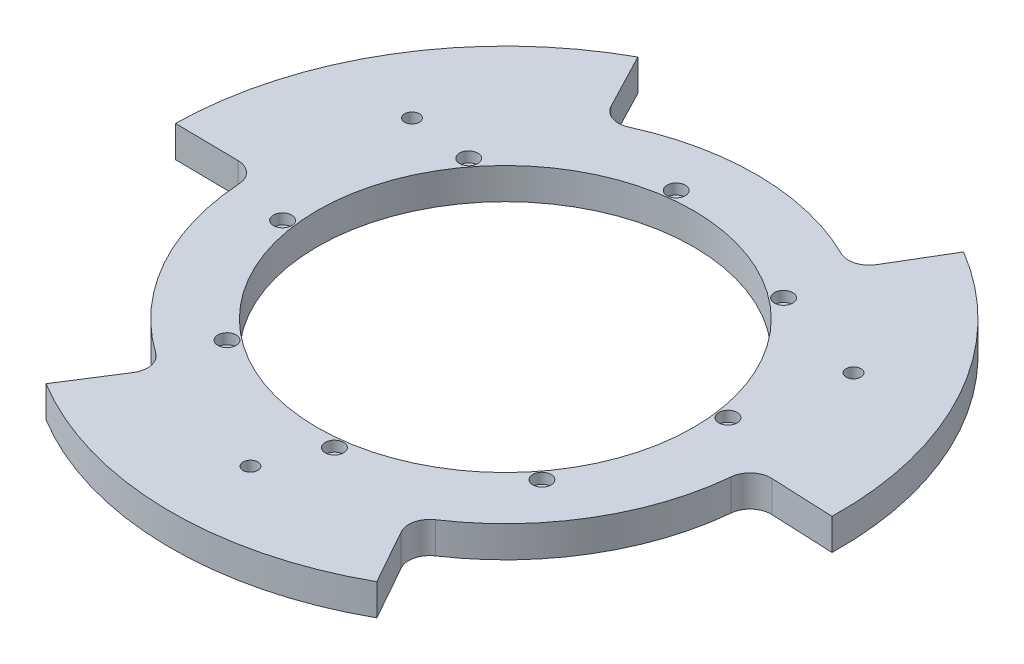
ISO-10303-21;
HEADER;
FILE_DESCRIPTION(('STEP AP214'),'2;1');
FILE_NAME('part.step','',(''),(''),'','','');
FILE_SCHEMA(('AUTOMOTIVE_DESIGN { 1 0 10303 214 1 1 1 1 }'));
ENDSEC;
DATA;
#1=APPLICATION_CONTEXT('core data for automotive mechanical design processes');
#2=APPLICATION_PROTOCOL_DEFINITION('international standard','automotive_design',2000,#1);
#3=PRODUCT_CONTEXT('',#1,'mechanical');
#4=PRODUCT('Part','Part','',(#3));
#5=PRODUCT_RELATED_PRODUCT_CATEGORY('part','',(#4));
#6=PRODUCT_DEFINITION_FORMATION('','',#4);
#7=PRODUCT_DEFINITION_CONTEXT('part definition',#1,'design');
#8=PRODUCT_DEFINITION('design','',#6,#7);
#9=PRODUCT_DEFINITION_SHAPE('','',#8);
#10=(LENGTH_UNIT() NAMED_UNIT(*) SI_UNIT(.MILLI.,.METRE.));
#11=(NAMED_UNIT(*) PLANE_ANGLE_UNIT() SI_UNIT($,.RADIAN.));
#12=(NAMED_UNIT(*) SI_UNIT($,.STERADIAN.) SOLID_ANGLE_UNIT());
#13=UNCERTAINTY_MEASURE_WITH_UNIT(LENGTH_MEASURE(1.E-05),#10,'distance_accuracy_value','');
#14=(GEOMETRIC_REPRESENTATION_CONTEXT(3) GLOBAL_UNCERTAINTY_ASSIGNED_CONTEXT((#13)) GLOBAL_UNIT_ASSIGNED_CONTEXT((#10,
#11,#12)) REPRESENTATION_CONTEXT('',''));
#15=CARTESIAN_POINT('',(0.,0.,0.));
#16=DIRECTION('',(0.,0.,1.));
#17=DIRECTION('',(1.,0.,0.));
#18=AXIS2_PLACEMENT_3D('',#15,#16,#17);
#19=CARTESIAN_POINT('',(-36.7235332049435,9.525,47.8590402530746));
#20=DIRECTION('',(0.,-1.,0.));
#21=DIRECTION('',(0.,0.,-1.));
#22=AXIS2_PLACEMENT_3D('',#19,#20,#21);
#23=CYLINDRICAL_SURFACE('',#22,1.4732);
#24=CARTESIAN_POINT('',(-36.7235332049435,0.,47.8590402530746));
#25=DIRECTION('',(0.,-1.,0.));
#26=DIRECTION('',(0.,0.,-1.));
#27=AXIS2_PLACEMENT_3D('',#24,#25,#26);
#28=CIRCLE('',#27,1.4732);
#29=CARTESIAN_POINT('',(-36.7235332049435,0.,46.3858402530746));
#30=VERTEX_POINT('',#29);
#31=EDGE_CURVE('E351',#30,#30,#28,.T.);
#32=CARTESIAN_POINT('',(-36.7235332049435,6.35,47.8590402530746));
#33=DIRECTION('',(0.,1.,0.));
#34=DIRECTION('',(0.,0.,1.));
#35=AXIS2_PLACEMENT_3D('',#32,#33,#34);
#36=CIRCLE('',#35,1.4732);
#37=CARTESIAN_POINT('',(-36.7235332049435,6.35,46.3858402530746));
#38=VERTEX_POINT('',#37);
#39=EDGE_CURVE('E39',#38,#38,#36,.F.);
#40=CARTESIAN_POINT('',(-36.7235332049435,0.,46.3858402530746));
#41=CARTESIAN_POINT('',(-36.7235332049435,0.0661458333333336,46.3858402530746));
#42=CARTESIAN_POINT('',(-36.7235332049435,0.132291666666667,46.3858402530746));
#43=CARTESIAN_POINT('',(-36.7235332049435,0.264583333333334,46.3858402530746));
#44=CARTESIAN_POINT('',(-36.7235332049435,0.330729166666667,46.3858402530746));
#45=CARTESIAN_POINT('',(-36.7235332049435,0.463020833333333,46.3858402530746));
#46=CARTESIAN_POINT('',(-36.7235332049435,0.529166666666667,46.3858402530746));
#47=CARTESIAN_POINT('',(-36.7235332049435,0.661458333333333,46.3858402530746));
#48=CARTESIAN_POINT('',(-36.7235332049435,0.727604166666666,46.3858402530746));
#49=CARTESIAN_POINT('',(-36.7235332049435,0.859895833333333,46.3858402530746));
#50=CARTESIAN_POINT('',(-36.7235332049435,0.926041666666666,46.3858402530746));
#51=CARTESIAN_POINT('',(-36.7235332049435,1.05833333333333,46.3858402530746));
#52=CARTESIAN_POINT('',(-36.7235332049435,1.12447916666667,46.3858402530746));
#53=CARTESIAN_POINT('',(-36.7235332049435,1.25677083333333,46.3858402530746));
#54=CARTESIAN_POINT('',(-36.7235332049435,1.32291666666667,46.3858402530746));
#55=CARTESIAN_POINT('',(-36.7235332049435,1.45520833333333,46.3858402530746));
#56=CARTESIAN_POINT('',(-36.7235332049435,1.52135416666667,46.3858402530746));
#57=CARTESIAN_POINT('',(-36.7235332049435,1.65364583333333,46.3858402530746));
#58=CARTESIAN_POINT('',(-36.7235332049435,1.71979166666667,46.3858402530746));
#59=CARTESIAN_POINT('',(-36.7235332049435,1.85208333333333,46.3858402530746));
#60=CARTESIAN_POINT('',(-36.7235332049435,1.91822916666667,46.3858402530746));
#61=CARTESIAN_POINT('',(-36.7235332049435,2.05052083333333,46.3858402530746));
#62=CARTESIAN_POINT('',(-36.7235332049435,2.11666666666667,46.3858402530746));
#63=CARTESIAN_POINT('',(-36.7235332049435,2.24895833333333,46.3858402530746));
#64=CARTESIAN_POINT('',(-36.7235332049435,2.31510416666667,46.3858402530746));
#65=CARTESIAN_POINT('',(-36.7235332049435,2.44739583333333,46.3858402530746));
#66=CARTESIAN_POINT('',(-36.7235332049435,2.51354166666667,46.3858402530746));
#67=CARTESIAN_POINT('',(-36.7235332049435,2.64583333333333,46.3858402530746));
#68=CARTESIAN_POINT('',(-36.7235332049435,2.71197916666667,46.3858402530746));
#69=CARTESIAN_POINT('',(-36.7235332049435,2.84427083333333,46.3858402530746));
#70=CARTESIAN_POINT('',(-36.7235332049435,2.91041666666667,46.3858402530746));
#71=CARTESIAN_POINT('',(-36.7235332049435,3.04270833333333,46.3858402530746));
#72=CARTESIAN_POINT('',(-36.7235332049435,3.10885416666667,46.3858402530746));
#73=CARTESIAN_POINT('',(-36.7235332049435,3.24114583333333,46.3858402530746));
#74=CARTESIAN_POINT('',(-36.7235332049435,3.30729166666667,46.3858402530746));
#75=CARTESIAN_POINT('',(-36.7235332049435,3.43958333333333,46.3858402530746));
#76=CARTESIAN_POINT('',(-36.7235332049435,3.50572916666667,46.3858402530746));
#77=CARTESIAN_POINT('',(-36.7235332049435,3.63802083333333,46.3858402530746));
#78=CARTESIAN_POINT('',(-36.7235332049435,3.70416666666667,46.3858402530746));
#79=CARTESIAN_POINT('',(-36.7235332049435,3.83645833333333,46.3858402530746));
#80=CARTESIAN_POINT('',(-36.7235332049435,3.90260416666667,46.3858402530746));
#81=CARTESIAN_POINT('',(-36.7235332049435,4.03489583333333,46.3858402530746));
#82=CARTESIAN_POINT('',(-36.7235332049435,4.10104166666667,46.3858402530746));
#83=CARTESIAN_POINT('',(-36.7235332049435,4.23333333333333,46.3858402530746));
#84=CARTESIAN_POINT('',(-36.7235332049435,4.29947916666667,46.3858402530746));
#85=CARTESIAN_POINT('',(-36.7235332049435,4.43177083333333,46.3858402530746));
#86=CARTESIAN_POINT('',(-36.7235332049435,4.49791666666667,46.3858402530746));
#87=CARTESIAN_POINT('',(-36.7235332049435,4.63020833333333,46.3858402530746));
#88=CARTESIAN_POINT('',(-36.7235332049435,4.69635416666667,46.3858402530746));
#89=CARTESIAN_POINT('',(-36.7235332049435,4.82864583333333,46.3858402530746));
#90=CARTESIAN_POINT('',(-36.7235332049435,4.89479166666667,46.3858402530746));
#91=CARTESIAN_POINT('',(-36.7235332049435,5.02708333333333,46.3858402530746));
#92=CARTESIAN_POINT('',(-36.7235332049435,5.09322916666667,46.3858402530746));
#93=CARTESIAN_POINT('',(-36.7235332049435,5.22552083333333,46.3858402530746));
#94=CARTESIAN_POINT('',(-36.7235332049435,5.29166666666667,46.3858402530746));
#95=CARTESIAN_POINT('',(-36.7235332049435,5.42395833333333,46.3858402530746));
#96=CARTESIAN_POINT('',(-36.7235332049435,5.49010416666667,46.3858402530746));
#97=CARTESIAN_POINT('',(-36.7235332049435,5.62239583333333,46.3858402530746));
#98=CARTESIAN_POINT('',(-36.7235332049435,5.68854166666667,46.3858402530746));
#99=CARTESIAN_POINT('',(-36.7235332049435,5.82083333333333,46.3858402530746));
#100=CARTESIAN_POINT('',(-36.7235332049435,5.88697916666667,46.3858402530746));
#101=CARTESIAN_POINT('',(-36.7235332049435,6.01927083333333,46.3858402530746));
#102=CARTESIAN_POINT('',(-36.7235332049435,6.08541666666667,46.3858402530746));
#103=CARTESIAN_POINT('',(-36.7235332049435,6.21770833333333,46.3858402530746));
#104=CARTESIAN_POINT('',(-36.7235332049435,6.28385416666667,46.3858402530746));
#105=CARTESIAN_POINT('',(-36.7235332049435,6.35,46.3858402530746));
#106=B_SPLINE_CURVE_WITH_KNOTS('',3,(#40,#41,#42,#43,#44,#45,#46,#47,#48,#49,#50,#51,#52,#53,
#54,#55,#56,#57,#58,#59,#60,#61,#62,#63,#64,#65,#66,#67,#68,#69,#70,#71,#72,#73,#74,#75,#76,#77,
#78,#79,#80,#81,#82,#83,#84,#85,#86,#87,#88,#89,#90,#91,#92,#93,#94,#95,#96,#97,#98,#99,#100,
#101,#102,#103,#104,#105),.UNSPECIFIED.,.F.,.F.,(4,2,2,2,2,2,2,2,2,2,2,2,2,2,2,2,2,2,2,2,2,2,2,
2,2,2,2,2,2,2,2,2,4),(0.,0.198437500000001,0.396875,0.5953125,0.793749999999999,0.9921875,
1.190625,1.3890625,1.5875,1.7859375,1.984375,2.1828125,2.38125,2.5796875,2.778125,2.9765625,
3.175,3.3734375,3.571875,3.7703125,3.96875,4.1671875,4.365625,4.5640625,4.7625,4.9609375,
5.159375,5.3578125,5.55625,5.7546875,5.953125,6.1515625,6.35),.UNSPECIFIED.);
#107=EDGE_CURVE('BSEAM35',#30,#38,#106,.T.);
#108=ORIENTED_EDGE('',*,*,#31,.T.);
#109=ORIENTED_EDGE('',*,*,#39,.F.);
#110=ORIENTED_EDGE('',*,*,#107,.T.);
#111=ORIENTED_EDGE('',*,*,#107,.F.);
#112=EDGE_LOOP('',(#108,#110,#109,#111));
#113=FACE_BOUND('',#112,.T.);
#114=ADVANCED_FACE('F35',(#113),#23,.F.);
#115=CARTESIAN_POINT('',(-47.8590402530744,9.525,-36.7235332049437));
#116=DIRECTION('',(0.,-1.,0.));
#117=DIRECTION('',(0.,0.,-1.));
#118=AXIS2_PLACEMENT_3D('',#115,#116,#117);
#119=CYLINDRICAL_SURFACE('',#118,1.47320000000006);
#120=CARTESIAN_POINT('',(-47.8590402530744,0.,-36.7235332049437));
#121=DIRECTION('',(0.,-1.,0.));
#122=DIRECTION('',(0.,0.,-1.));
#123=AXIS2_PLACEMENT_3D('',#120,#121,#122);
#124=CIRCLE('',#123,1.47320000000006);
#125=CARTESIAN_POINT('',(-47.8590402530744,0.,-38.1967332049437));
#126=VERTEX_POINT('',#125);
#127=EDGE_CURVE('E354',#126,#126,#124,.T.);
#128=CARTESIAN_POINT('',(-47.8590402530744,6.35,-36.7235332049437));
#129=DIRECTION('',(0.,1.,0.));
#130=DIRECTION('',(0.,0.,1.));
#131=AXIS2_PLACEMENT_3D('',#128,#129,#130);
#132=CIRCLE('',#131,1.47320000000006);
#133=CARTESIAN_POINT('',(-47.8590402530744,6.35,-38.1967332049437));
#134=VERTEX_POINT('',#133);
#135=EDGE_CURVE('E328',#134,#134,#132,.F.);
#136=CARTESIAN_POINT('',(-47.8590402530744,0.,-38.1967332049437));
#137=CARTESIAN_POINT('',(-47.8590402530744,0.0661458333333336,-38.1967332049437));
#138=CARTESIAN_POINT('',(-47.8590402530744,0.132291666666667,-38.1967332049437));
#139=CARTESIAN_POINT('',(-47.8590402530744,0.264583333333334,-38.1967332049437));
#140=CARTESIAN_POINT('',(-47.8590402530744,0.330729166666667,-38.1967332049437));
#141=CARTESIAN_POINT('',(-47.8590402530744,0.463020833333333,-38.1967332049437));
#142=CARTESIAN_POINT('',(-47.8590402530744,0.529166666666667,-38.1967332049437));
#143=CARTESIAN_POINT('',(-47.8590402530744,0.661458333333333,-38.1967332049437));
#144=CARTESIAN_POINT('',(-47.8590402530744,0.727604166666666,-38.1967332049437));
#145=CARTESIAN_POINT('',(-47.8590402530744,0.859895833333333,-38.1967332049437));
#146=CARTESIAN_POINT('',(-47.8590402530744,0.926041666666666,-38.1967332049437));
#147=CARTESIAN_POINT('',(-47.8590402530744,1.05833333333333,-38.1967332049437));
#148=CARTESIAN_POINT('',(-47.8590402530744,1.12447916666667,-38.1967332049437));
#149=CARTESIAN_POINT('',(-47.8590402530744,1.25677083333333,-38.1967332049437));
#150=CARTESIAN_POINT('',(-47.8590402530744,1.32291666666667,-38.1967332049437));
#151=CARTESIAN_POINT('',(-47.8590402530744,1.45520833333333,-38.1967332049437));
#152=CARTESIAN_POINT('',(-47.8590402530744,1.52135416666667,-38.1967332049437));
#153=CARTESIAN_POINT('',(-47.8590402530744,1.65364583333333,-38.1967332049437));
#154=CARTESIAN_POINT('',(-47.8590402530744,1.71979166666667,-38.1967332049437));
#155=CARTESIAN_POINT('',(-47.8590402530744,1.85208333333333,-38.1967332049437));
#156=CARTESIAN_POINT('',(-47.8590402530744,1.91822916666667,-38.1967332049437));
#157=CARTESIAN_POINT('',(-47.8590402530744,2.05052083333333,-38.1967332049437));
#158=CARTESIAN_POINT('',(-47.8590402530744,2.11666666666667,-38.1967332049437));
#159=CARTESIAN_POINT('',(-47.8590402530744,2.24895833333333,-38.1967332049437));
#160=CARTESIAN_POINT('',(-47.8590402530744,2.31510416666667,-38.1967332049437));
#161=CARTESIAN_POINT('',(-47.8590402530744,2.44739583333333,-38.1967332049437));
#162=CARTESIAN_POINT('',(-47.8590402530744,2.51354166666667,-38.1967332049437));
#163=CARTESIAN_POINT('',(-47.8590402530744,2.64583333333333,-38.1967332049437));
#164=CARTESIAN_POINT('',(-47.8590402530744,2.71197916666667,-38.1967332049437));
#165=CARTESIAN_POINT('',(-47.8590402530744,2.84427083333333,-38.1967332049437));
#166=CARTESIAN_POINT('',(-47.8590402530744,2.91041666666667,-38.1967332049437));
#167=CARTESIAN_POINT('',(-47.8590402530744,3.04270833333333,-38.1967332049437));
#168=CARTESIAN_POINT('',(-47.8590402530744,3.10885416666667,-38.1967332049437));
#169=CARTESIAN_POINT('',(-47.8590402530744,3.24114583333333,-38.1967332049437));
#170=CARTESIAN_POINT('',(-47.8590402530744,3.30729166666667,-38.1967332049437));
#171=CARTESIAN_POINT('',(-47.8590402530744,3.43958333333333,-38.1967332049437));
#172=CARTESIAN_POINT('',(-47.8590402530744,3.50572916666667,-38.1967332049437));
#173=CARTESIAN_POINT('',(-47.8590402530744,3.63802083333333,-38.1967332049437));
#174=CARTESIAN_POINT('',(-47.8590402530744,3.70416666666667,-38.1967332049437));
#175=CARTESIAN_POINT('',(-47.8590402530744,3.83645833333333,-38.1967332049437));
#176=CARTESIAN_POINT('',(-47.8590402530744,3.90260416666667,-38.1967332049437));
#177=CARTESIAN_POINT('',(-47.8590402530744,4.03489583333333,-38.1967332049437));
#178=CARTESIAN_POINT('',(-47.8590402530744,4.10104166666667,-38.1967332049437));
#179=CARTESIAN_POINT('',(-47.8590402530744,4.23333333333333,-38.1967332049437));
#180=CARTESIAN_POINT('',(-47.8590402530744,4.29947916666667,-38.1967332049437));
#181=CARTESIAN_POINT('',(-47.8590402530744,4.43177083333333,-38.1967332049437));
#182=CARTESIAN_POINT('',(-47.8590402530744,4.49791666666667,-38.1967332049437));
#183=CARTESIAN_POINT('',(-47.8590402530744,4.63020833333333,-38.1967332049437));
#184=CARTESIAN_POINT('',(-47.8590402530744,4.69635416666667,-38.1967332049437));
#185=CARTESIAN_POINT('',(-47.8590402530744,4.82864583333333,-38.1967332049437));
#186=CARTESIAN_POINT('',(-47.8590402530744,4.89479166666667,-38.1967332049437));
#187=CARTESIAN_POINT('',(-47.8590402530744,5.02708333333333,-38.1967332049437));
#188=CARTESIAN_POINT('',(-47.8590402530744,5.09322916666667,-38.1967332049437));
#189=CARTESIAN_POINT('',(-47.8590402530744,5.22552083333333,-38.1967332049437));
#190=CARTESIAN_POINT('',(-47.8590402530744,5.29166666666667,-38.1967332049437));
#191=CARTESIAN_POINT('',(-47.8590402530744,5.42395833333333,-38.1967332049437));
#192=CARTESIAN_POINT('',(-47.8590402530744,5.49010416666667,-38.1967332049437));
#193=CARTESIAN_POINT('',(-47.8590402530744,5.62239583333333,-38.1967332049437));
#194=CARTESIAN_POINT('',(-47.8590402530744,5.68854166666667,-38.1967332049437));
#195=CARTESIAN_POINT('',(-47.8590402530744,5.82083333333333,-38.1967332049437));
#196=CARTESIAN_POINT('',(-47.8590402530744,5.88697916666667,-38.1967332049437));
#197=CARTESIAN_POINT('',(-47.8590402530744,6.01927083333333,-38.1967332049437));
#198=CARTESIAN_POINT('',(-47.8590402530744,6.08541666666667,-38.1967332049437));
#199=CARTESIAN_POINT('',(-47.8590402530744,6.21770833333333,-38.1967332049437));
#200=CARTESIAN_POINT('',(-47.8590402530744,6.28385416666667,-38.1967332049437));
#201=CARTESIAN_POINT('',(-47.8590402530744,6.35,-38.1967332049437));
#202=B_SPLINE_CURVE_WITH_KNOTS('',3,(#136,#137,#138,#139,#140,#141,#142,#143,#144,#145,#146,
#147,#148,#149,#150,#151,#152,#153,#154,#155,#156,#157,#158,#159,#160,#161,#162,#163,#164,#165,
#166,#167,#168,#169,#170,#171,#172,#173,#174,#175,#176,#177,#178,#179,#180,#181,#182,#183,#184,
#185,#186,#187,#188,#189,#190,#191,#192,#193,#194,#195,#196,#197,#198,#199,#200,#201),
.UNSPECIFIED.,.F.,.F.,(4,2,2,2,2,2,2,2,2,2,2,2,2,2,2,2,2,2,2,2,2,2,2,2,2,2,2,2,2,2,2,2,4),(0.,
0.198437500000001,0.396875,0.5953125,0.793749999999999,0.9921875,1.190625,1.3890625,1.5875,
1.7859375,1.984375,2.1828125,2.38125,2.5796875,2.778125,2.9765625,3.175,3.3734375,3.571875,
3.7703125,3.96875,4.1671875,4.365625,4.5640625,4.7625,4.9609375,5.159375,5.3578125,5.55625,
5.7546875,5.953125,6.1515625,6.35),.UNSPECIFIED.);
#203=EDGE_CURVE('BSEAM441',#126,#134,#202,.T.);
#204=ORIENTED_EDGE('',*,*,#127,.T.);
#205=ORIENTED_EDGE('',*,*,#135,.F.);
#206=ORIENTED_EDGE('',*,*,#203,.T.);
#207=ORIENTED_EDGE('',*,*,#203,.F.);
#208=EDGE_LOOP('',(#204,#206,#205,#207));
#209=FACE_BOUND('',#208,.T.);
#210=ADVANCED_FACE('F441',(#209),#119,.F.);
#211=CARTESIAN_POINT('',(-7.87399254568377,9.525,-59.8089112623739));
#212=DIRECTION('',(0.,-1.,0.));
#213=DIRECTION('',(0.,0.,-1.));
#214=AXIS2_PLACEMENT_3D('',#211,#212,#213);
#215=CYLINDRICAL_SURFACE('',#214,1.4732);
#216=CARTESIAN_POINT('',(-7.87399254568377,0.,-59.8089112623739));
#217=DIRECTION('',(0.,-1.,0.));
#218=DIRECTION('',(0.,0.,-1.));
#219=AXIS2_PLACEMENT_3D('',#216,#217,#218);
#220=CIRCLE('',#219,1.4732);
#221=CARTESIAN_POINT('',(-7.87399254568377,0.,-61.2821112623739));
#222=VERTEX_POINT('',#221);
#223=EDGE_CURVE('E357',#222,#222,#220,.T.);
#224=CARTESIAN_POINT('',(-7.87399254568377,6.35,-59.8089112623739));
#225=DIRECTION('',(0.,1.,0.));
#226=DIRECTION('',(0.,0.,1.));
#227=AXIS2_PLACEMENT_3D('',#224,#225,#226);
#228=CIRCLE('',#227,1.4732);
#229=CARTESIAN_POINT('',(-7.87399254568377,6.35,-61.2821112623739));
#230=VERTEX_POINT('',#229);
#231=EDGE_CURVE('E326',#230,#230,#228,.F.);
#232=CARTESIAN_POINT('',(-7.87399254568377,0.,-61.2821112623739));
#233=CARTESIAN_POINT('',(-7.87399254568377,0.0661458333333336,-61.2821112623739));
#234=CARTESIAN_POINT('',(-7.87399254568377,0.132291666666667,-61.2821112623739));
#235=CARTESIAN_POINT('',(-7.87399254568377,0.264583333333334,-61.2821112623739));
#236=CARTESIAN_POINT('',(-7.87399254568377,0.330729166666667,-61.2821112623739));
#237=CARTESIAN_POINT('',(-7.87399254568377,0.463020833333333,-61.2821112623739));
#238=CARTESIAN_POINT('',(-7.87399254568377,0.529166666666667,-61.2821112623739));
#239=CARTESIAN_POINT('',(-7.87399254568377,0.661458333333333,-61.2821112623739));
#240=CARTESIAN_POINT('',(-7.87399254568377,0.727604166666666,-61.2821112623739));
#241=CARTESIAN_POINT('',(-7.87399254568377,0.859895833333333,-61.2821112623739));
#242=CARTESIAN_POINT('',(-7.87399254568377,0.926041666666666,-61.2821112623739));
#243=CARTESIAN_POINT('',(-7.87399254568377,1.05833333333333,-61.2821112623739));
#244=CARTESIAN_POINT('',(-7.87399254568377,1.12447916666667,-61.2821112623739));
#245=CARTESIAN_POINT('',(-7.87399254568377,1.25677083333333,-61.2821112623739));
#246=CARTESIAN_POINT('',(-7.87399254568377,1.32291666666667,-61.2821112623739));
#247=CARTESIAN_POINT('',(-7.87399254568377,1.45520833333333,-61.2821112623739));
#248=CARTESIAN_POINT('',(-7.87399254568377,1.52135416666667,-61.2821112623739));
#249=CARTESIAN_POINT('',(-7.87399254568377,1.65364583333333,-61.2821112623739));
#250=CARTESIAN_POINT('',(-7.87399254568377,1.71979166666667,-61.2821112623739));
#251=CARTESIAN_POINT('',(-7.87399254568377,1.85208333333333,-61.2821112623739));
#252=CARTESIAN_POINT('',(-7.87399254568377,1.91822916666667,-61.2821112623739));
#253=CARTESIAN_POINT('',(-7.87399254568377,2.05052083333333,-61.2821112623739));
#254=CARTESIAN_POINT('',(-7.87399254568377,2.11666666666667,-61.2821112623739));
#255=CARTESIAN_POINT('',(-7.87399254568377,2.24895833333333,-61.2821112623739));
#256=CARTESIAN_POINT('',(-7.87399254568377,2.31510416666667,-61.2821112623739));
#257=CARTESIAN_POINT('',(-7.87399254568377,2.44739583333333,-61.2821112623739));
#258=CARTESIAN_POINT('',(-7.87399254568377,2.51354166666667,-61.2821112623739));
#259=CARTESIAN_POINT('',(-7.87399254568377,2.64583333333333,-61.2821112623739));
#260=CARTESIAN_POINT('',(-7.87399254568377,2.71197916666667,-61.2821112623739));
#261=CARTESIAN_POINT('',(-7.87399254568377,2.84427083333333,-61.2821112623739));
#262=CARTESIAN_POINT('',(-7.87399254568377,2.91041666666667,-61.2821112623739));
#263=CARTESIAN_POINT('',(-7.87399254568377,3.04270833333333,-61.2821112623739));
#264=CARTESIAN_POINT('',(-7.87399254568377,3.10885416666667,-61.2821112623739));
#265=CARTESIAN_POINT('',(-7.87399254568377,3.24114583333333,-61.2821112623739));
#266=CARTESIAN_POINT('',(-7.87399254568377,3.30729166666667,-61.2821112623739));
#267=CARTESIAN_POINT('',(-7.87399254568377,3.43958333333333,-61.2821112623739));
#268=CARTESIAN_POINT('',(-7.87399254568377,3.50572916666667,-61.2821112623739));
#269=CARTESIAN_POINT('',(-7.87399254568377,3.63802083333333,-61.2821112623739));
#270=CARTESIAN_POINT('',(-7.87399254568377,3.70416666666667,-61.2821112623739));
#271=CARTESIAN_POINT('',(-7.87399254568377,3.83645833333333,-61.2821112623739));
#272=CARTESIAN_POINT('',(-7.87399254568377,3.90260416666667,-61.2821112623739));
#273=CARTESIAN_POINT('',(-7.87399254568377,4.03489583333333,-61.2821112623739));
#274=CARTESIAN_POINT('',(-7.87399254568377,4.10104166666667,-61.2821112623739));
#275=CARTESIAN_POINT('',(-7.87399254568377,4.23333333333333,-61.2821112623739));
#276=CARTESIAN_POINT('',(-7.87399254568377,4.29947916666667,-61.2821112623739));
#277=CARTESIAN_POINT('',(-7.87399254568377,4.43177083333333,-61.2821112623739));
#278=CARTESIAN_POINT('',(-7.87399254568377,4.49791666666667,-61.2821112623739));
#279=CARTESIAN_POINT('',(-7.87399254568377,4.63020833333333,-61.2821112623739));
#280=CARTESIAN_POINT('',(-7.87399254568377,4.69635416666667,-61.2821112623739));
#281=CARTESIAN_POINT('',(-7.87399254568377,4.82864583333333,-61.2821112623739));
#282=CARTESIAN_POINT('',(-7.87399254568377,4.89479166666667,-61.2821112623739));
#283=CARTESIAN_POINT('',(-7.87399254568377,5.02708333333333,-61.2821112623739));
#284=CARTESIAN_POINT('',(-7.87399254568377,5.09322916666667,-61.2821112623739));
#285=CARTESIAN_POINT('',(-7.87399254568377,5.22552083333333,-61.2821112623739));
#286=CARTESIAN_POINT('',(-7.87399254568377,5.29166666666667,-61.2821112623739));
#287=CARTESIAN_POINT('',(-7.87399254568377,5.42395833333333,-61.2821112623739));
#288=CARTESIAN_POINT('',(-7.87399254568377,5.49010416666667,-61.2821112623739));
#289=CARTESIAN_POINT('',(-7.87399254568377,5.62239583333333,-61.2821112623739));
#290=CARTESIAN_POINT('',(-7.87399254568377,5.68854166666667,-61.2821112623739));
#291=CARTESIAN_POINT('',(-7.87399254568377,5.82083333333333,-61.2821112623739));
#292=CARTESIAN_POINT('',(-7.87399254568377,5.88697916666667,-61.2821112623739));
#293=CARTESIAN_POINT('',(-7.87399254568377,6.01927083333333,-61.2821112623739));
#294=CARTESIAN_POINT('',(-7.87399254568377,6.08541666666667,-61.2821112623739));
#295=CARTESIAN_POINT('',(-7.87399254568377,6.21770833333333,-61.2821112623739));
#296=CARTESIAN_POINT('',(-7.87399254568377,6.28385416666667,-61.2821112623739));
#297=CARTESIAN_POINT('',(-7.87399254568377,6.35,-61.2821112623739));
#298=B_SPLINE_CURVE_WITH_KNOTS('',3,(#232,#233,#234,#235,#236,#237,#238,#239,#240,#241,#242,
#243,#244,#245,#246,#247,#248,#249,#250,#251,#252,#253,#254,#255,#256,#257,#258,#259,#260,#261,
#262,#263,#264,#265,#266,#267,#268,#269,#270,#271,#272,#273,#274,#275,#276,#277,#278,#279,#280,
#281,#282,#283,#284,#285,#286,#287,#288,#289,#290,#291,#292,#293,#294,#295,#296,#297),
.UNSPECIFIED.,.F.,.F.,(4,2,2,2,2,2,2,2,2,2,2,2,2,2,2,2,2,2,2,2,2,2,2,2,2,2,2,2,2,2,2,2,4),(0.,
0.198437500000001,0.396875,0.5953125,0.793749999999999,0.9921875,1.190625,1.3890625,1.5875,
1.7859375,1.984375,2.1828125,2.38125,2.5796875,2.778125,2.9765625,3.175,3.3734375,3.571875,
3.7703125,3.96875,4.1671875,4.365625,4.5640625,4.7625,4.9609375,5.159375,5.3578125,5.55625,
5.7546875,5.953125,6.1515625,6.35),.UNSPECIFIED.);
#299=EDGE_CURVE('BSEAM448',#222,#230,#298,.T.);
#300=ORIENTED_EDGE('',*,*,#223,.T.);
#301=ORIENTED_EDGE('',*,*,#231,.F.);
#302=ORIENTED_EDGE('',*,*,#299,.T.);
#303=ORIENTED_EDGE('',*,*,#299,.F.);
#304=EDGE_LOOP('',(#300,#302,#301,#303));
#305=FACE_BOUND('',#304,.T.);
#306=ADVANCED_FACE('F448',(#305),#215,.F.);
#307=CARTESIAN_POINT('',(36.7235332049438,9.525,-47.8590402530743));
#308=DIRECTION('',(0.,-1.,0.));
#309=DIRECTION('',(0.,0.,-1.));
#310=AXIS2_PLACEMENT_3D('',#307,#308,#309);
#311=CYLINDRICAL_SURFACE('',#310,1.4732);
#312=CARTESIAN_POINT('',(36.7235332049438,0.,-47.8590402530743));
#313=DIRECTION('',(0.,-1.,0.));
#314=DIRECTION('',(0.,0.,-1.));
#315=AXIS2_PLACEMENT_3D('',#312,#313,#314);
#316=CIRCLE('',#315,1.4732);
#317=CARTESIAN_POINT('',(36.7235332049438,0.,-49.3322402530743));
#318=VERTEX_POINT('',#317);
#319=EDGE_CURVE('E349',#318,#318,#316,.T.);
#320=CARTESIAN_POINT('',(36.7235332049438,6.35,-47.8590402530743));
#321=DIRECTION('',(0.,1.,0.));
#322=DIRECTION('',(0.,0.,1.));
#323=AXIS2_PLACEMENT_3D('',#320,#321,#322);
#324=CIRCLE('',#323,1.4732);
#325=CARTESIAN_POINT('',(36.7235332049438,6.35,-49.3322402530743));
#326=VERTEX_POINT('',#325);
#327=EDGE_CURVE('E323',#326,#326,#324,.F.);
#328=CARTESIAN_POINT('',(36.7235332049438,0.,-49.3322402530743));
#329=CARTESIAN_POINT('',(36.7235332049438,0.0661458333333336,-49.3322402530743));
#330=CARTESIAN_POINT('',(36.7235332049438,0.132291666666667,-49.3322402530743));
#331=CARTESIAN_POINT('',(36.7235332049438,0.264583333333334,-49.3322402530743));
#332=CARTESIAN_POINT('',(36.7235332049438,0.330729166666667,-49.3322402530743));
#333=CARTESIAN_POINT('',(36.7235332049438,0.463020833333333,-49.3322402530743));
#334=CARTESIAN_POINT('',(36.7235332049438,0.529166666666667,-49.3322402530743));
#335=CARTESIAN_POINT('',(36.7235332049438,0.661458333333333,-49.3322402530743));
#336=CARTESIAN_POINT('',(36.7235332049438,0.727604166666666,-49.3322402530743));
#337=CARTESIAN_POINT('',(36.7235332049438,0.859895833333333,-49.3322402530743));
#338=CARTESIAN_POINT('',(36.7235332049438,0.926041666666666,-49.3322402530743));
#339=CARTESIAN_POINT('',(36.7235332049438,1.05833333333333,-49.3322402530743));
#340=CARTESIAN_POINT('',(36.7235332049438,1.12447916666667,-49.3322402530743));
#341=CARTESIAN_POINT('',(36.7235332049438,1.25677083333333,-49.3322402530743));
#342=CARTESIAN_POINT('',(36.7235332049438,1.32291666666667,-49.3322402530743));
#343=CARTESIAN_POINT('',(36.7235332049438,1.45520833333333,-49.3322402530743));
#344=CARTESIAN_POINT('',(36.7235332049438,1.52135416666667,-49.3322402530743));
#345=CARTESIAN_POINT('',(36.7235332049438,1.65364583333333,-49.3322402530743));
#346=CARTESIAN_POINT('',(36.7235332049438,1.71979166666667,-49.3322402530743));
#347=CARTESIAN_POINT('',(36.7235332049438,1.85208333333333,-49.3322402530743));
#348=CARTESIAN_POINT('',(36.7235332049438,1.91822916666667,-49.3322402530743));
#349=CARTESIAN_POINT('',(36.7235332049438,2.05052083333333,-49.3322402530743));
#350=CARTESIAN_POINT('',(36.7235332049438,2.11666666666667,-49.3322402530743));
#351=CARTESIAN_POINT('',(36.7235332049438,2.24895833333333,-49.3322402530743));
#352=CARTESIAN_POINT('',(36.7235332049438,2.31510416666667,-49.3322402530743));
#353=CARTESIAN_POINT('',(36.7235332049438,2.44739583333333,-49.3322402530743));
#354=CARTESIAN_POINT('',(36.7235332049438,2.51354166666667,-49.3322402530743));
#355=CARTESIAN_POINT('',(36.7235332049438,2.64583333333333,-49.3322402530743));
#356=CARTESIAN_POINT('',(36.7235332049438,2.71197916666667,-49.3322402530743));
#357=CARTESIAN_POINT('',(36.7235332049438,2.84427083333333,-49.3322402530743));
#358=CARTESIAN_POINT('',(36.7235332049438,2.91041666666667,-49.3322402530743));
#359=CARTESIAN_POINT('',(36.7235332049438,3.04270833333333,-49.3322402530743));
#360=CARTESIAN_POINT('',(36.7235332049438,3.10885416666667,-49.3322402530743));
#361=CARTESIAN_POINT('',(36.7235332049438,3.24114583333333,-49.3322402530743));
#362=CARTESIAN_POINT('',(36.7235332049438,3.30729166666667,-49.3322402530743));
#363=CARTESIAN_POINT('',(36.7235332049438,3.43958333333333,-49.3322402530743));
#364=CARTESIAN_POINT('',(36.7235332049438,3.50572916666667,-49.3322402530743));
#365=CARTESIAN_POINT('',(36.7235332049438,3.63802083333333,-49.3322402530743));
#366=CARTESIAN_POINT('',(36.7235332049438,3.70416666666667,-49.3322402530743));
#367=CARTESIAN_POINT('',(36.7235332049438,3.83645833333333,-49.3322402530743));
#368=CARTESIAN_POINT('',(36.7235332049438,3.90260416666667,-49.3322402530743));
#369=CARTESIAN_POINT('',(36.7235332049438,4.03489583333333,-49.3322402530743));
#370=CARTESIAN_POINT('',(36.7235332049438,4.10104166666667,-49.3322402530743));
#371=CARTESIAN_POINT('',(36.7235332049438,4.23333333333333,-49.3322402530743));
#372=CARTESIAN_POINT('',(36.7235332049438,4.29947916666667,-49.3322402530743));
#373=CARTESIAN_POINT('',(36.7235332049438,4.43177083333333,-49.3322402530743));
#374=CARTESIAN_POINT('',(36.7235332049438,4.49791666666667,-49.3322402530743));
#375=CARTESIAN_POINT('',(36.7235332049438,4.63020833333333,-49.3322402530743));
#376=CARTESIAN_POINT('',(36.7235332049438,4.69635416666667,-49.3322402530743));
#377=CARTESIAN_POINT('',(36.7235332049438,4.82864583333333,-49.3322402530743));
#378=CARTESIAN_POINT('',(36.7235332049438,4.89479166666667,-49.3322402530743));
#379=CARTESIAN_POINT('',(36.7235332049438,5.02708333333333,-49.3322402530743));
#380=CARTESIAN_POINT('',(36.7235332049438,5.09322916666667,-49.3322402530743));
#381=CARTESIAN_POINT('',(36.7235332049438,5.22552083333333,-49.3322402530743));
#382=CARTESIAN_POINT('',(36.7235332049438,5.29166666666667,-49.3322402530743));
#383=CARTESIAN_POINT('',(36.7235332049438,5.42395833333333,-49.3322402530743));
#384=CARTESIAN_POINT('',(36.7235332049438,5.49010416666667,-49.3322402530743));
#385=CARTESIAN_POINT('',(36.7235332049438,5.62239583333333,-49.3322402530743));
#386=CARTESIAN_POINT('',(36.7235332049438,5.68854166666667,-49.3322402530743));
#387=CARTESIAN_POINT('',(36.7235332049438,5.82083333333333,-49.3322402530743));
#388=CARTESIAN_POINT('',(36.7235332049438,5.88697916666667,-49.3322402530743));
#389=CARTESIAN_POINT('',(36.7235332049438,6.01927083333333,-49.3322402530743));
#390=CARTESIAN_POINT('',(36.7235332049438,6.08541666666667,-49.3322402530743));
#391=CARTESIAN_POINT('',(36.7235332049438,6.21770833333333,-49.3322402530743));
#392=CARTESIAN_POINT('',(36.7235332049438,6.28385416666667,-49.3322402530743));
#393=CARTESIAN_POINT('',(36.7235332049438,6.35,-49.3322402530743));
#394=B_SPLINE_CURVE_WITH_KNOTS('',3,(#328,#329,#330,#331,#332,#333,#334,#335,#336,#337,#338,
#339,#340,#341,#342,#343,#344,#345,#346,#347,#348,#349,#350,#351,#352,#353,#354,#355,#356,#357,
#358,#359,#360,#361,#362,#363,#364,#365,#366,#367,#368,#369,#370,#371,#372,#373,#374,#375,#376,
#377,#378,#379,#380,#381,#382,#383,#384,#385,#386,#387,#388,#389,#390,#391,#392,#393),
.UNSPECIFIED.,.F.,.F.,(4,2,2,2,2,2,2,2,2,2,2,2,2,2,2,2,2,2,2,2,2,2,2,2,2,2,2,2,2,2,2,2,4),(0.,
0.198437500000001,0.396875,0.5953125,0.793749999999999,0.9921875,1.190625,1.3890625,1.5875,
1.7859375,1.984375,2.1828125,2.38125,2.5796875,2.778125,2.9765625,3.175,3.3734375,3.571875,
3.7703125,3.96875,4.1671875,4.365625,4.5640625,4.7625,4.9609375,5.159375,5.3578125,5.55625,
5.7546875,5.953125,6.1515625,6.35),.UNSPECIFIED.);
#395=EDGE_CURVE('BSEAM458',#318,#326,#394,.T.);
#396=ORIENTED_EDGE('',*,*,#319,.T.);
#397=ORIENTED_EDGE('',*,*,#327,.F.);
#398=ORIENTED_EDGE('',*,*,#395,.T.);
#399=ORIENTED_EDGE('',*,*,#395,.F.);
#400=EDGE_LOOP('',(#396,#398,#397,#399));
#401=FACE_BOUND('',#400,.T.);
#402=ADVANCED_FACE('F458',(#401),#311,.F.);
#403=CARTESIAN_POINT('',(47.8590402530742,9.525,36.723533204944));
#404=DIRECTION('',(0.,-1.,0.));
#405=DIRECTION('',(0.,0.,-1.));
#406=AXIS2_PLACEMENT_3D('',#403,#404,#405);
#407=CYLINDRICAL_SURFACE('',#406,1.4732);
#408=CARTESIAN_POINT('',(47.8590402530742,0.,36.723533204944));
#409=DIRECTION('',(0.,-1.,0.));
#410=DIRECTION('',(0.,0.,-1.));
#411=AXIS2_PLACEMENT_3D('',#408,#409,#410);
#412=CIRCLE('',#411,1.4732);
#413=CARTESIAN_POINT('',(47.8590402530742,0.,35.250333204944));
#414=VERTEX_POINT('',#413);
#415=EDGE_CURVE('E333',#414,#414,#412,.T.);
#416=CARTESIAN_POINT('',(47.8590402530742,6.35,36.723533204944));
#417=DIRECTION('',(0.,1.,0.));
#418=DIRECTION('',(0.,0.,1.));
#419=AXIS2_PLACEMENT_3D('',#416,#417,#418);
#420=CIRCLE('',#419,1.4732);
#421=CARTESIAN_POINT('',(47.8590402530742,6.35,35.250333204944));
#422=VERTEX_POINT('',#421);
#423=EDGE_CURVE('E320',#422,#422,#420,.F.);
#424=CARTESIAN_POINT('',(47.8590402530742,0.,35.250333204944));
#425=CARTESIAN_POINT('',(47.8590402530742,0.0661458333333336,35.250333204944));
#426=CARTESIAN_POINT('',(47.8590402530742,0.132291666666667,35.250333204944));
#427=CARTESIAN_POINT('',(47.8590402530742,0.264583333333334,35.250333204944));
#428=CARTESIAN_POINT('',(47.8590402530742,0.330729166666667,35.250333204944));
#429=CARTESIAN_POINT('',(47.8590402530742,0.463020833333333,35.250333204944));
#430=CARTESIAN_POINT('',(47.8590402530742,0.529166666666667,35.250333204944));
#431=CARTESIAN_POINT('',(47.8590402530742,0.661458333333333,35.250333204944));
#432=CARTESIAN_POINT('',(47.8590402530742,0.727604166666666,35.250333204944));
#433=CARTESIAN_POINT('',(47.8590402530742,0.859895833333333,35.250333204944));
#434=CARTESIAN_POINT('',(47.8590402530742,0.926041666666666,35.250333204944));
#435=CARTESIAN_POINT('',(47.8590402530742,1.05833333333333,35.250333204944));
#436=CARTESIAN_POINT('',(47.8590402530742,1.12447916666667,35.250333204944));
#437=CARTESIAN_POINT('',(47.8590402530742,1.25677083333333,35.250333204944));
#438=CARTESIAN_POINT('',(47.8590402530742,1.32291666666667,35.250333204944));
#439=CARTESIAN_POINT('',(47.8590402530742,1.45520833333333,35.250333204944));
#440=CARTESIAN_POINT('',(47.8590402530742,1.52135416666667,35.250333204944));
#441=CARTESIAN_POINT('',(47.8590402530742,1.65364583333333,35.250333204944));
#442=CARTESIAN_POINT('',(47.8590402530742,1.71979166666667,35.250333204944));
#443=CARTESIAN_POINT('',(47.8590402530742,1.85208333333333,35.250333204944));
#444=CARTESIAN_POINT('',(47.8590402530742,1.91822916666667,35.250333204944));
#445=CARTESIAN_POINT('',(47.8590402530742,2.05052083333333,35.250333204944));
#446=CARTESIAN_POINT('',(47.8590402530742,2.11666666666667,35.250333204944));
#447=CARTESIAN_POINT('',(47.8590402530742,2.24895833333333,35.250333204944));
#448=CARTESIAN_POINT('',(47.8590402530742,2.31510416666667,35.250333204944));
#449=CARTESIAN_POINT('',(47.8590402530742,2.44739583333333,35.250333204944));
#450=CARTESIAN_POINT('',(47.8590402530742,2.51354166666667,35.250333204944));
#451=CARTESIAN_POINT('',(47.8590402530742,2.64583333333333,35.250333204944));
#452=CARTESIAN_POINT('',(47.8590402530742,2.71197916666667,35.250333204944));
#453=CARTESIAN_POINT('',(47.8590402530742,2.84427083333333,35.250333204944));
#454=CARTESIAN_POINT('',(47.8590402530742,2.91041666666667,35.250333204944));
#455=CARTESIAN_POINT('',(47.8590402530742,3.04270833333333,35.250333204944));
#456=CARTESIAN_POINT('',(47.8590402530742,3.10885416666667,35.250333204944));
#457=CARTESIAN_POINT('',(47.8590402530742,3.24114583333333,35.250333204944));
#458=CARTESIAN_POINT('',(47.8590402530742,3.30729166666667,35.250333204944));
#459=CARTESIAN_POINT('',(47.8590402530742,3.43958333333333,35.250333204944));
#460=CARTESIAN_POINT('',(47.8590402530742,3.50572916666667,35.250333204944));
#461=CARTESIAN_POINT('',(47.8590402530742,3.63802083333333,35.250333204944));
#462=CARTESIAN_POINT('',(47.8590402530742,3.70416666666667,35.250333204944));
#463=CARTESIAN_POINT('',(47.8590402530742,3.83645833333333,35.250333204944));
#464=CARTESIAN_POINT('',(47.8590402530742,3.90260416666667,35.250333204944));
#465=CARTESIAN_POINT('',(47.8590402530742,4.03489583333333,35.250333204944));
#466=CARTESIAN_POINT('',(47.8590402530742,4.10104166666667,35.250333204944));
#467=CARTESIAN_POINT('',(47.8590402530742,4.23333333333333,35.250333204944));
#468=CARTESIAN_POINT('',(47.8590402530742,4.29947916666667,35.250333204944));
#469=CARTESIAN_POINT('',(47.8590402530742,4.43177083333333,35.250333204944));
#470=CARTESIAN_POINT('',(47.8590402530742,4.49791666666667,35.250333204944));
#471=CARTESIAN_POINT('',(47.8590402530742,4.63020833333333,35.250333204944));
#472=CARTESIAN_POINT('',(47.8590402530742,4.69635416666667,35.250333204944));
#473=CARTESIAN_POINT('',(47.8590402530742,4.82864583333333,35.250333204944));
#474=CARTESIAN_POINT('',(47.8590402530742,4.89479166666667,35.250333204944));
#475=CARTESIAN_POINT('',(47.8590402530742,5.02708333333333,35.250333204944));
#476=CARTESIAN_POINT('',(47.8590402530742,5.09322916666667,35.250333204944));
#477=CARTESIAN_POINT('',(47.8590402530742,5.22552083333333,35.250333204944));
#478=CARTESIAN_POINT('',(47.8590402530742,5.29166666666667,35.250333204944));
#479=CARTESIAN_POINT('',(47.8590402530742,5.42395833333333,35.250333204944));
#480=CARTESIAN_POINT('',(47.8590402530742,5.49010416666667,35.250333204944));
#481=CARTESIAN_POINT('',(47.8590402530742,5.62239583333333,35.250333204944));
#482=CARTESIAN_POINT('',(47.8590402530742,5.68854166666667,35.250333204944));
#483=CARTESIAN_POINT('',(47.8590402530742,5.82083333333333,35.250333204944));
#484=CARTESIAN_POINT('',(47.8590402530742,5.88697916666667,35.250333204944));
#485=CARTESIAN_POINT('',(47.8590402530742,6.01927083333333,35.250333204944));
#486=CARTESIAN_POINT('',(47.8590402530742,6.08541666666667,35.250333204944));
#487=CARTESIAN_POINT('',(47.8590402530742,6.21770833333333,35.250333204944));
#488=CARTESIAN_POINT('',(47.8590402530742,6.28385416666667,35.250333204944));
#489=CARTESIAN_POINT('',(47.8590402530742,6.35,35.250333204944));
#490=B_SPLINE_CURVE_WITH_KNOTS('',3,(#424,#425,#426,#427,#428,#429,#430,#431,#432,#433,#434,
#435,#436,#437,#438,#439,#440,#441,#442,#443,#444,#445,#446,#447,#448,#449,#450,#451,#452,#453,
#454,#455,#456,#457,#458,#459,#460,#461,#462,#463,#464,#465,#466,#467,#468,#469,#470,#471,#472,
#473,#474,#475,#476,#477,#478,#479,#480,#481,#482,#483,#484,#485,#486,#487,#488,#489),
.UNSPECIFIED.,.F.,.F.,(4,2,2,2,2,2,2,2,2,2,2,2,2,2,2,2,2,2,2,2,2,2,2,2,2,2,2,2,2,2,2,2,4),(0.,
0.198437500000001,0.396875,0.5953125,0.793749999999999,0.9921875,1.190625,1.3890625,1.5875,
1.7859375,1.984375,2.1828125,2.38125,2.5796875,2.778125,2.9765625,3.175,3.3734375,3.571875,
3.7703125,3.96875,4.1671875,4.365625,4.5640625,4.7625,4.9609375,5.159375,5.3578125,5.55625,
5.7546875,5.953125,6.1515625,6.35),.UNSPECIFIED.);
#491=EDGE_CURVE('BSEAM462',#414,#422,#490,.T.);
#492=ORIENTED_EDGE('',*,*,#415,.T.);
#493=ORIENTED_EDGE('',*,*,#423,.F.);
#494=ORIENTED_EDGE('',*,*,#491,.T.);
#495=ORIENTED_EDGE('',*,*,#491,.F.);
#496=EDGE_LOOP('',(#492,#494,#493,#495));
#497=FACE_BOUND('',#496,.T.);
#498=ADVANCED_FACE('F462',(#497),#407,.F.);
#499=CARTESIAN_POINT('',(7.87399254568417,9.525,59.8089112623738));
#500=DIRECTION('',(0.,-1.,0.));
#501=DIRECTION('',(0.,0.,-1.));
#502=AXIS2_PLACEMENT_3D('',#499,#500,#501);
#503=CYLINDRICAL_SURFACE('',#502,1.4732);
#504=CARTESIAN_POINT('',(7.87399254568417,0.,59.8089112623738));
#505=DIRECTION('',(0.,-1.,0.));
#506=DIRECTION('',(0.,0.,-1.));
#507=AXIS2_PLACEMENT_3D('',#504,#505,#506);
#508=CIRCLE('',#507,1.4732);
#509=CARTESIAN_POINT('',(7.87399254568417,0.,58.3357112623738));
#510=VERTEX_POINT('',#509);
#511=EDGE_CURVE('E337',#510,#510,#508,.T.);
#512=CARTESIAN_POINT('',(7.87399254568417,6.35,59.8089112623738));
#513=DIRECTION('',(0.,1.,0.));
#514=DIRECTION('',(0.,0.,1.));
#515=AXIS2_PLACEMENT_3D('',#512,#513,#514);
#516=CIRCLE('',#515,1.4732);
#517=CARTESIAN_POINT('',(7.87399254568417,6.35,58.3357112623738));
#518=VERTEX_POINT('',#517);
#519=EDGE_CURVE('E317',#518,#518,#516,.F.);
#520=CARTESIAN_POINT('',(7.87399254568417,0.,58.3357112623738));
#521=CARTESIAN_POINT('',(7.87399254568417,0.0661458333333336,58.3357112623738));
#522=CARTESIAN_POINT('',(7.87399254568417,0.132291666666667,58.3357112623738));
#523=CARTESIAN_POINT('',(7.87399254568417,0.264583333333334,58.3357112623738));
#524=CARTESIAN_POINT('',(7.87399254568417,0.330729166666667,58.3357112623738));
#525=CARTESIAN_POINT('',(7.87399254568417,0.463020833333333,58.3357112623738));
#526=CARTESIAN_POINT('',(7.87399254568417,0.529166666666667,58.3357112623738));
#527=CARTESIAN_POINT('',(7.87399254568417,0.661458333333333,58.3357112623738));
#528=CARTESIAN_POINT('',(7.87399254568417,0.727604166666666,58.3357112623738));
#529=CARTESIAN_POINT('',(7.87399254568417,0.859895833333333,58.3357112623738));
#530=CARTESIAN_POINT('',(7.87399254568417,0.926041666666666,58.3357112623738));
#531=CARTESIAN_POINT('',(7.87399254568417,1.05833333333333,58.3357112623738));
#532=CARTESIAN_POINT('',(7.87399254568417,1.12447916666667,58.3357112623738));
#533=CARTESIAN_POINT('',(7.87399254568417,1.25677083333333,58.3357112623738));
#534=CARTESIAN_POINT('',(7.87399254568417,1.32291666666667,58.3357112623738));
#535=CARTESIAN_POINT('',(7.87399254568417,1.45520833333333,58.3357112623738));
#536=CARTESIAN_POINT('',(7.87399254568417,1.52135416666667,58.3357112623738));
#537=CARTESIAN_POINT('',(7.87399254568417,1.65364583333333,58.3357112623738));
#538=CARTESIAN_POINT('',(7.87399254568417,1.71979166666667,58.3357112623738));
#539=CARTESIAN_POINT('',(7.87399254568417,1.85208333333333,58.3357112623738));
#540=CARTESIAN_POINT('',(7.87399254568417,1.91822916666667,58.3357112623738));
#541=CARTESIAN_POINT('',(7.87399254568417,2.05052083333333,58.3357112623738));
#542=CARTESIAN_POINT('',(7.87399254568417,2.11666666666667,58.3357112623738));
#543=CARTESIAN_POINT('',(7.87399254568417,2.24895833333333,58.3357112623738));
#544=CARTESIAN_POINT('',(7.87399254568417,2.31510416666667,58.3357112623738));
#545=CARTESIAN_POINT('',(7.87399254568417,2.44739583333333,58.3357112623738));
#546=CARTESIAN_POINT('',(7.87399254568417,2.51354166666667,58.3357112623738));
#547=CARTESIAN_POINT('',(7.87399254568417,2.64583333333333,58.3357112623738));
#548=CARTESIAN_POINT('',(7.87399254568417,2.71197916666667,58.3357112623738));
#549=CARTESIAN_POINT('',(7.87399254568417,2.84427083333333,58.3357112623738));
#550=CARTESIAN_POINT('',(7.87399254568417,2.91041666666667,58.3357112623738));
#551=CARTESIAN_POINT('',(7.87399254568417,3.04270833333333,58.3357112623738));
#552=CARTESIAN_POINT('',(7.87399254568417,3.10885416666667,58.3357112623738));
#553=CARTESIAN_POINT('',(7.87399254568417,3.24114583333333,58.3357112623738));
#554=CARTESIAN_POINT('',(7.87399254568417,3.30729166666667,58.3357112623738));
#555=CARTESIAN_POINT('',(7.87399254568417,3.43958333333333,58.3357112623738));
#556=CARTESIAN_POINT('',(7.87399254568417,3.50572916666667,58.3357112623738));
#557=CARTESIAN_POINT('',(7.87399254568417,3.63802083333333,58.3357112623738));
#558=CARTESIAN_POINT('',(7.87399254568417,3.70416666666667,58.3357112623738));
#559=CARTESIAN_POINT('',(7.87399254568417,3.83645833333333,58.3357112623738));
#560=CARTESIAN_POINT('',(7.87399254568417,3.90260416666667,58.3357112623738));
#561=CARTESIAN_POINT('',(7.87399254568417,4.03489583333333,58.3357112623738));
#562=CARTESIAN_POINT('',(7.87399254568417,4.10104166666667,58.3357112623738));
#563=CARTESIAN_POINT('',(7.87399254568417,4.23333333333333,58.3357112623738));
#564=CARTESIAN_POINT('',(7.87399254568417,4.29947916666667,58.3357112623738));
#565=CARTESIAN_POINT('',(7.87399254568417,4.43177083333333,58.3357112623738));
#566=CARTESIAN_POINT('',(7.87399254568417,4.49791666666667,58.3357112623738));
#567=CARTESIAN_POINT('',(7.87399254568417,4.63020833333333,58.3357112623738));
#568=CARTESIAN_POINT('',(7.87399254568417,4.69635416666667,58.3357112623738));
#569=CARTESIAN_POINT('',(7.87399254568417,4.82864583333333,58.3357112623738));
#570=CARTESIAN_POINT('',(7.87399254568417,4.89479166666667,58.3357112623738));
#571=CARTESIAN_POINT('',(7.87399254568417,5.02708333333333,58.3357112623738));
#572=CARTESIAN_POINT('',(7.87399254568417,5.09322916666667,58.3357112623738));
#573=CARTESIAN_POINT('',(7.87399254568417,5.22552083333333,58.3357112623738));
#574=CARTESIAN_POINT('',(7.87399254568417,5.29166666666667,58.3357112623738));
#575=CARTESIAN_POINT('',(7.87399254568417,5.42395833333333,58.3357112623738));
#576=CARTESIAN_POINT('',(7.87399254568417,5.49010416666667,58.3357112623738));
#577=CARTESIAN_POINT('',(7.87399254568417,5.62239583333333,58.3357112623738));
#578=CARTESIAN_POINT('',(7.87399254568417,5.68854166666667,58.3357112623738));
#579=CARTESIAN_POINT('',(7.87399254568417,5.82083333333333,58.3357112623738));
#580=CARTESIAN_POINT('',(7.87399254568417,5.88697916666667,58.3357112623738));
#581=CARTESIAN_POINT('',(7.87399254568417,6.01927083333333,58.3357112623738));
#582=CARTESIAN_POINT('',(7.87399254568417,6.08541666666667,58.3357112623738));
#583=CARTESIAN_POINT('',(7.87399254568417,6.21770833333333,58.3357112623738));
#584=CARTESIAN_POINT('',(7.87399254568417,6.28385416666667,58.3357112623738));
#585=CARTESIAN_POINT('',(7.87399254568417,6.35,58.3357112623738));
#586=B_SPLINE_CURVE_WITH_KNOTS('',3,(#520,#521,#522,#523,#524,#525,#526,#527,#528,#529,#530,
#531,#532,#533,#534,#535,#536,#537,#538,#539,#540,#541,#542,#543,#544,#545,#546,#547,#548,#549,
#550,#551,#552,#553,#554,#555,#556,#557,#558,#559,#560,#561,#562,#563,#564,#565,#566,#567,#568,
#569,#570,#571,#572,#573,#574,#575,#576,#577,#578,#579,#580,#581,#582,#583,#584,#585),
.UNSPECIFIED.,.F.,.F.,(4,2,2,2,2,2,2,2,2,2,2,2,2,2,2,2,2,2,2,2,2,2,2,2,2,2,2,2,2,2,2,2,4),(0.,
0.198437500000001,0.396875,0.5953125,0.793749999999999,0.9921875,1.190625,1.3890625,1.5875,
1.7859375,1.984375,2.1828125,2.38125,2.5796875,2.778125,2.9765625,3.175,3.3734375,3.571875,
3.7703125,3.96875,4.1671875,4.365625,4.5640625,4.7625,4.9609375,5.159375,5.3578125,5.55625,
5.7546875,5.953125,6.1515625,6.35),.UNSPECIFIED.);
#587=EDGE_CURVE('BSEAM453',#510,#518,#586,.T.);
#588=ORIENTED_EDGE('',*,*,#511,.T.);
#589=ORIENTED_EDGE('',*,*,#519,.F.);
#590=ORIENTED_EDGE('',*,*,#587,.T.);
#591=ORIENTED_EDGE('',*,*,#587,.F.);
#592=EDGE_LOOP('',(#588,#590,#589,#591));
#593=FACE_BOUND('',#592,.T.);
#594=ADVANCED_FACE('F453',(#593),#503,.F.);
#595=CARTESIAN_POINT('',(59.8089112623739,9.525,-7.87399254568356));
#596=DIRECTION('',(0.,-1.,0.));
#597=DIRECTION('',(0.,0.,-1.));
#598=AXIS2_PLACEMENT_3D('',#595,#596,#597);
#599=CYLINDRICAL_SURFACE('',#598,1.47320000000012);
#600=CARTESIAN_POINT('',(59.8089112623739,0.,-7.87399254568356));
#601=DIRECTION('',(0.,-1.,0.));
#602=DIRECTION('',(0.,0.,-1.));
#603=AXIS2_PLACEMENT_3D('',#600,#601,#602);
#604=CIRCLE('',#603,1.47320000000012);
#605=CARTESIAN_POINT('',(59.8089112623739,0.,-9.34719254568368));
#606=VERTEX_POINT('',#605);
#607=EDGE_CURVE('E342',#606,#606,#604,.T.);
#608=CARTESIAN_POINT('',(59.8089112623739,6.35,-7.87399254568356));
#609=DIRECTION('',(0.,1.,0.));
#610=DIRECTION('',(0.,0.,1.));
#611=AXIS2_PLACEMENT_3D('',#608,#609,#610);
#612=CIRCLE('',#611,1.47320000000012);
#613=CARTESIAN_POINT('',(59.8089112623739,6.35,-9.34719254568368));
#614=VERTEX_POINT('',#613);
#615=EDGE_CURVE('E313',#614,#614,#612,.F.);
#616=CARTESIAN_POINT('',(59.8089112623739,0.,-9.34719254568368));
#617=CARTESIAN_POINT('',(59.8089112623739,0.0661458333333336,-9.34719254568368));
#618=CARTESIAN_POINT('',(59.8089112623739,0.132291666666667,-9.34719254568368));
#619=CARTESIAN_POINT('',(59.8089112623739,0.264583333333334,-9.34719254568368));
#620=CARTESIAN_POINT('',(59.8089112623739,0.330729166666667,-9.34719254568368));
#621=CARTESIAN_POINT('',(59.8089112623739,0.463020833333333,-9.34719254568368));
#622=CARTESIAN_POINT('',(59.8089112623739,0.529166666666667,-9.34719254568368));
#623=CARTESIAN_POINT('',(59.8089112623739,0.661458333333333,-9.34719254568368));
#624=CARTESIAN_POINT('',(59.8089112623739,0.727604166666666,-9.34719254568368));
#625=CARTESIAN_POINT('',(59.8089112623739,0.859895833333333,-9.34719254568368));
#626=CARTESIAN_POINT('',(59.8089112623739,0.926041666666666,-9.34719254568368));
#627=CARTESIAN_POINT('',(59.8089112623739,1.05833333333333,-9.34719254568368));
#628=CARTESIAN_POINT('',(59.8089112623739,1.12447916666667,-9.34719254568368));
#629=CARTESIAN_POINT('',(59.8089112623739,1.25677083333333,-9.34719254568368));
#630=CARTESIAN_POINT('',(59.8089112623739,1.32291666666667,-9.34719254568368));
#631=CARTESIAN_POINT('',(59.8089112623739,1.45520833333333,-9.34719254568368));
#632=CARTESIAN_POINT('',(59.8089112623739,1.52135416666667,-9.34719254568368));
#633=CARTESIAN_POINT('',(59.8089112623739,1.65364583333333,-9.34719254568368));
#634=CARTESIAN_POINT('',(59.8089112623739,1.71979166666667,-9.34719254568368));
#635=CARTESIAN_POINT('',(59.8089112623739,1.85208333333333,-9.34719254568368));
#636=CARTESIAN_POINT('',(59.8089112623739,1.91822916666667,-9.34719254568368));
#637=CARTESIAN_POINT('',(59.8089112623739,2.05052083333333,-9.34719254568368));
#638=CARTESIAN_POINT('',(59.8089112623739,2.11666666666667,-9.34719254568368));
#639=CARTESIAN_POINT('',(59.8089112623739,2.24895833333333,-9.34719254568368));
#640=CARTESIAN_POINT('',(59.8089112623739,2.31510416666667,-9.34719254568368));
#641=CARTESIAN_POINT('',(59.8089112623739,2.44739583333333,-9.34719254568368));
#642=CARTESIAN_POINT('',(59.8089112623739,2.51354166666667,-9.34719254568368));
#643=CARTESIAN_POINT('',(59.8089112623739,2.64583333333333,-9.34719254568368));
#644=CARTESIAN_POINT('',(59.8089112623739,2.71197916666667,-9.34719254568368));
#645=CARTESIAN_POINT('',(59.8089112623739,2.84427083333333,-9.34719254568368));
#646=CARTESIAN_POINT('',(59.8089112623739,2.91041666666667,-9.34719254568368));
#647=CARTESIAN_POINT('',(59.8089112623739,3.04270833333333,-9.34719254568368));
#648=CARTESIAN_POINT('',(59.8089112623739,3.10885416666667,-9.34719254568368));
#649=CARTESIAN_POINT('',(59.8089112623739,3.24114583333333,-9.34719254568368));
#650=CARTESIAN_POINT('',(59.8089112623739,3.30729166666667,-9.34719254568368));
#651=CARTESIAN_POINT('',(59.8089112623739,3.43958333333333,-9.34719254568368));
#652=CARTESIAN_POINT('',(59.8089112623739,3.50572916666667,-9.34719254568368));
#653=CARTESIAN_POINT('',(59.8089112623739,3.63802083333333,-9.34719254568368));
#654=CARTESIAN_POINT('',(59.8089112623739,3.70416666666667,-9.34719254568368));
#655=CARTESIAN_POINT('',(59.8089112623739,3.83645833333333,-9.34719254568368));
#656=CARTESIAN_POINT('',(59.8089112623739,3.90260416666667,-9.34719254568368));
#657=CARTESIAN_POINT('',(59.8089112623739,4.03489583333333,-9.34719254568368));
#658=CARTESIAN_POINT('',(59.8089112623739,4.10104166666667,-9.34719254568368));
#659=CARTESIAN_POINT('',(59.8089112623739,4.23333333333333,-9.34719254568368));
#660=CARTESIAN_POINT('',(59.8089112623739,4.29947916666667,-9.34719254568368));
#661=CARTESIAN_POINT('',(59.8089112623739,4.43177083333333,-9.34719254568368));
#662=CARTESIAN_POINT('',(59.8089112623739,4.49791666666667,-9.34719254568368));
#663=CARTESIAN_POINT('',(59.8089112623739,4.63020833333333,-9.34719254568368));
#664=CARTESIAN_POINT('',(59.8089112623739,4.69635416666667,-9.34719254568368));
#665=CARTESIAN_POINT('',(59.8089112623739,4.82864583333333,-9.34719254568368));
#666=CARTESIAN_POINT('',(59.8089112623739,4.89479166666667,-9.34719254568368));
#667=CARTESIAN_POINT('',(59.8089112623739,5.02708333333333,-9.34719254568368));
#668=CARTESIAN_POINT('',(59.8089112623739,5.09322916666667,-9.34719254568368));
#669=CARTESIAN_POINT('',(59.8089112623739,5.22552083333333,-9.34719254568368));
#670=CARTESIAN_POINT('',(59.8089112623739,5.29166666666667,-9.34719254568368));
#671=CARTESIAN_POINT('',(59.8089112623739,5.42395833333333,-9.34719254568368));
#672=CARTESIAN_POINT('',(59.8089112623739,5.49010416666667,-9.34719254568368));
#673=CARTESIAN_POINT('',(59.8089112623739,5.62239583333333,-9.34719254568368));
#674=CARTESIAN_POINT('',(59.8089112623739,5.68854166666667,-9.34719254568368));
#675=CARTESIAN_POINT('',(59.8089112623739,5.82083333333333,-9.34719254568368));
#676=CARTESIAN_POINT('',(59.8089112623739,5.88697916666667,-9.34719254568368));
#677=CARTESIAN_POINT('',(59.8089112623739,6.01927083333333,-9.34719254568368));
#678=CARTESIAN_POINT('',(59.8089112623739,6.08541666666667,-9.34719254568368));
#679=CARTESIAN_POINT('',(59.8089112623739,6.21770833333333,-9.34719254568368));
#680=CARTESIAN_POINT('',(59.8089112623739,6.28385416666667,-9.34719254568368));
#681=CARTESIAN_POINT('',(59.8089112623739,6.35,-9.34719254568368));
#682=B_SPLINE_CURVE_WITH_KNOTS('',3,(#616,#617,#618,#619,#620,#621,#622,#623,#624,#625,#626,
#627,#628,#629,#630,#631,#632,#633,#634,#635,#636,#637,#638,#639,#640,#641,#642,#643,#644,#645,
#646,#647,#648,#649,#650,#651,#652,#653,#654,#655,#656,#657,#658,#659,#660,#661,#662,#663,#664,
#665,#666,#667,#668,#669,#670,#671,#672,#673,#674,#675,#676,#677,#678,#679,#680,#681),
.UNSPECIFIED.,.F.,.F.,(4,2,2,2,2,2,2,2,2,2,2,2,2,2,2,2,2,2,2,2,2,2,2,2,2,2,2,2,2,2,2,2,4),(0.,
0.198437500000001,0.396875,0.5953125,0.793749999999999,0.9921875,1.190625,1.3890625,1.5875,
1.7859375,1.984375,2.1828125,2.38125,2.5796875,2.778125,2.9765625,3.175,3.3734375,3.571875,
3.7703125,3.96875,4.1671875,4.365625,4.5640625,4.7625,4.9609375,5.159375,5.3578125,5.55625,
5.7546875,5.953125,6.1515625,6.35),.UNSPECIFIED.);
#683=EDGE_CURVE('BSEAM560',#606,#614,#682,.T.);
#684=ORIENTED_EDGE('',*,*,#607,.T.);
#685=ORIENTED_EDGE('',*,*,#615,.F.);
#686=ORIENTED_EDGE('',*,*,#683,.T.);
#687=ORIENTED_EDGE('',*,*,#683,.F.);
#688=EDGE_LOOP('',(#684,#686,#685,#687));
#689=FACE_BOUND('',#688,.T.);
#690=ADVANCED_FACE('F560',(#689),#599,.F.);
#691=CARTESIAN_POINT('',(-59.8089112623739,9.525,7.87399254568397));
#692=DIRECTION('',(0.,-1.,0.));
#693=DIRECTION('',(0.,0.,-1.));
#694=AXIS2_PLACEMENT_3D('',#691,#692,#693);
#695=CYLINDRICAL_SURFACE('',#694,1.4732);
#696=CARTESIAN_POINT('',(-59.8089112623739,0.,7.87399254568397));
#697=DIRECTION('',(0.,-1.,0.));
#698=DIRECTION('',(0.,0.,-1.));
#699=AXIS2_PLACEMENT_3D('',#696,#697,#698);
#700=CIRCLE('',#699,1.4732);
#701=CARTESIAN_POINT('',(-59.8089112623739,0.,6.40079254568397));
#702=VERTEX_POINT('',#701);
#703=EDGE_CURVE('E346',#702,#702,#700,.T.);
#704=CARTESIAN_POINT('',(-59.8089112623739,6.35,7.87399254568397));
#705=DIRECTION('',(0.,1.,0.));
#706=DIRECTION('',(0.,0.,1.));
#707=AXIS2_PLACEMENT_3D('',#704,#705,#706);
#708=CIRCLE('',#707,1.4732);
#709=CARTESIAN_POINT('',(-59.8089112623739,6.35,6.40079254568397));
#710=VERTEX_POINT('',#709);
#711=EDGE_CURVE('E310',#710,#710,#708,.F.);
#712=CARTESIAN_POINT('',(-59.8089112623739,0.,6.40079254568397));
#713=CARTESIAN_POINT('',(-59.8089112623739,0.0661458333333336,6.40079254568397));
#714=CARTESIAN_POINT('',(-59.8089112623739,0.132291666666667,6.40079254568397));
#715=CARTESIAN_POINT('',(-59.8089112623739,0.264583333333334,6.40079254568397));
#716=CARTESIAN_POINT('',(-59.8089112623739,0.330729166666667,6.40079254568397));
#717=CARTESIAN_POINT('',(-59.8089112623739,0.463020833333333,6.40079254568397));
#718=CARTESIAN_POINT('',(-59.8089112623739,0.529166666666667,6.40079254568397));
#719=CARTESIAN_POINT('',(-59.8089112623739,0.661458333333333,6.40079254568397));
#720=CARTESIAN_POINT('',(-59.8089112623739,0.727604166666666,6.40079254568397));
#721=CARTESIAN_POINT('',(-59.8089112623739,0.859895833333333,6.40079254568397));
#722=CARTESIAN_POINT('',(-59.8089112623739,0.926041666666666,6.40079254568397));
#723=CARTESIAN_POINT('',(-59.8089112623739,1.05833333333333,6.40079254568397));
#724=CARTESIAN_POINT('',(-59.8089112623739,1.12447916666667,6.40079254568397));
#725=CARTESIAN_POINT('',(-59.8089112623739,1.25677083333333,6.40079254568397));
#726=CARTESIAN_POINT('',(-59.8089112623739,1.32291666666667,6.40079254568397));
#727=CARTESIAN_POINT('',(-59.8089112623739,1.45520833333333,6.40079254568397));
#728=CARTESIAN_POINT('',(-59.8089112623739,1.52135416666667,6.40079254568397));
#729=CARTESIAN_POINT('',(-59.8089112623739,1.65364583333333,6.40079254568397));
#730=CARTESIAN_POINT('',(-59.8089112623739,1.71979166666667,6.40079254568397));
#731=CARTESIAN_POINT('',(-59.8089112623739,1.85208333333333,6.40079254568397));
#732=CARTESIAN_POINT('',(-59.8089112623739,1.91822916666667,6.40079254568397));
#733=CARTESIAN_POINT('',(-59.8089112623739,2.05052083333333,6.40079254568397));
#734=CARTESIAN_POINT('',(-59.8089112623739,2.11666666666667,6.40079254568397));
#735=CARTESIAN_POINT('',(-59.8089112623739,2.24895833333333,6.40079254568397));
#736=CARTESIAN_POINT('',(-59.8089112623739,2.31510416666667,6.40079254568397));
#737=CARTESIAN_POINT('',(-59.8089112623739,2.44739583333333,6.40079254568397));
#738=CARTESIAN_POINT('',(-59.8089112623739,2.51354166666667,6.40079254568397));
#739=CARTESIAN_POINT('',(-59.8089112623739,2.64583333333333,6.40079254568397));
#740=CARTESIAN_POINT('',(-59.8089112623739,2.71197916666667,6.40079254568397));
#741=CARTESIAN_POINT('',(-59.8089112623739,2.84427083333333,6.40079254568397));
#742=CARTESIAN_POINT('',(-59.8089112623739,2.91041666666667,6.40079254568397));
#743=CARTESIAN_POINT('',(-59.8089112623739,3.04270833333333,6.40079254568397));
#744=CARTESIAN_POINT('',(-59.8089112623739,3.10885416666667,6.40079254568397));
#745=CARTESIAN_POINT('',(-59.8089112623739,3.24114583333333,6.40079254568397));
#746=CARTESIAN_POINT('',(-59.8089112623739,3.30729166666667,6.40079254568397));
#747=CARTESIAN_POINT('',(-59.8089112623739,3.43958333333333,6.40079254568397));
#748=CARTESIAN_POINT('',(-59.8089112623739,3.50572916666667,6.40079254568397));
#749=CARTESIAN_POINT('',(-59.8089112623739,3.63802083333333,6.40079254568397));
#750=CARTESIAN_POINT('',(-59.8089112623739,3.70416666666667,6.40079254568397));
#751=CARTESIAN_POINT('',(-59.8089112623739,3.83645833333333,6.40079254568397));
#752=CARTESIAN_POINT('',(-59.8089112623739,3.90260416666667,6.40079254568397));
#753=CARTESIAN_POINT('',(-59.8089112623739,4.03489583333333,6.40079254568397));
#754=CARTESIAN_POINT('',(-59.8089112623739,4.10104166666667,6.40079254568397));
#755=CARTESIAN_POINT('',(-59.8089112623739,4.23333333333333,6.40079254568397));
#756=CARTESIAN_POINT('',(-59.8089112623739,4.29947916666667,6.40079254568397));
#757=CARTESIAN_POINT('',(-59.8089112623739,4.43177083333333,6.40079254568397));
#758=CARTESIAN_POINT('',(-59.8089112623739,4.49791666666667,6.40079254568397));
#759=CARTESIAN_POINT('',(-59.8089112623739,4.63020833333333,6.40079254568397));
#760=CARTESIAN_POINT('',(-59.8089112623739,4.69635416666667,6.40079254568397));
#761=CARTESIAN_POINT('',(-59.8089112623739,4.82864583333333,6.40079254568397));
#762=CARTESIAN_POINT('',(-59.8089112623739,4.89479166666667,6.40079254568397));
#763=CARTESIAN_POINT('',(-59.8089112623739,5.02708333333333,6.40079254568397));
#764=CARTESIAN_POINT('',(-59.8089112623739,5.09322916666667,6.40079254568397));
#765=CARTESIAN_POINT('',(-59.8089112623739,5.22552083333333,6.40079254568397));
#766=CARTESIAN_POINT('',(-59.8089112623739,5.29166666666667,6.40079254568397));
#767=CARTESIAN_POINT('',(-59.8089112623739,5.42395833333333,6.40079254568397));
#768=CARTESIAN_POINT('',(-59.8089112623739,5.49010416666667,6.40079254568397));
#769=CARTESIAN_POINT('',(-59.8089112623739,5.62239583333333,6.40079254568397));
#770=CARTESIAN_POINT('',(-59.8089112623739,5.68854166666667,6.40079254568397));
#771=CARTESIAN_POINT('',(-59.8089112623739,5.82083333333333,6.40079254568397));
#772=CARTESIAN_POINT('',(-59.8089112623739,5.88697916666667,6.40079254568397));
#773=CARTESIAN_POINT('',(-59.8089112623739,6.01927083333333,6.40079254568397));
#774=CARTESIAN_POINT('',(-59.8089112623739,6.08541666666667,6.40079254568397));
#775=CARTESIAN_POINT('',(-59.8089112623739,6.21770833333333,6.40079254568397));
#776=CARTESIAN_POINT('',(-59.8089112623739,6.28385416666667,6.40079254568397));
#777=CARTESIAN_POINT('',(-59.8089112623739,6.35,6.40079254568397));
#778=B_SPLINE_CURVE_WITH_KNOTS('',3,(#712,#713,#714,#715,#716,#717,#718,#719,#720,#721,#722,
#723,#724,#725,#726,#727,#728,#729,#730,#731,#732,#733,#734,#735,#736,#737,#738,#739,#740,#741,
#742,#743,#744,#745,#746,#747,#748,#749,#750,#751,#752,#753,#754,#755,#756,#757,#758,#759,#760,
#761,#762,#763,#764,#765,#766,#767,#768,#769,#770,#771,#772,#773,#774,#775,#776,#777),
.UNSPECIFIED.,.F.,.F.,(4,2,2,2,2,2,2,2,2,2,2,2,2,2,2,2,2,2,2,2,2,2,2,2,2,2,2,2,2,2,2,2,4),(0.,
0.198437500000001,0.396875,0.5953125,0.793749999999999,0.9921875,1.190625,1.3890625,1.5875,
1.7859375,1.984375,2.1828125,2.38125,2.5796875,2.778125,2.9765625,3.175,3.3734375,3.571875,
3.7703125,3.96875,4.1671875,4.365625,4.5640625,4.7625,4.9609375,5.159375,5.3578125,5.55625,
5.7546875,5.953125,6.1515625,6.35),.UNSPECIFIED.);
#779=EDGE_CURVE('BSEAM382',#702,#710,#778,.T.);
#780=ORIENTED_EDGE('',*,*,#703,.T.);
#781=ORIENTED_EDGE('',*,*,#711,.F.);
#782=ORIENTED_EDGE('',*,*,#779,.T.);
#783=ORIENTED_EDGE('',*,*,#779,.F.);
#784=EDGE_LOOP('',(#780,#782,#781,#783));
#785=FACE_BOUND('',#784,.T.);
#786=ADVANCED_FACE('F382',(#785),#695,.F.);
#787=CARTESIAN_POINT('',(0.,9.525,0.));
#788=DIRECTION('',(0.,-1.,0.));
#789=DIRECTION('',(0.,0.,-1.));
#790=AXIS2_PLACEMENT_3D('',#787,#788,#789);
#791=CYLINDRICAL_SURFACE('',#790,101.6);
#792=CARTESIAN_POINT('',(0.,0.,0.));
#793=DIRECTION('',(0.,1.,0.));
#794=DIRECTION('',(0.,0.,1.));
#795=AXIS2_PLACEMENT_3D('',#792,#793,#794);
#796=CIRCLE('',#795,101.6);
#797=CARTESIAN_POINT('',(101.574186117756,0.,2.29013416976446));
#798=VERTEX_POINT('',#797);
#799=CARTESIAN_POINT('',(51.9745301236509,0.,-87.2995316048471));
#800=VERTEX_POINT('',#799);
#801=EDGE_CURVE('E307',#798,#800,#796,.T.);
#802=ORIENTED_EDGE('',*,*,#801,.T.);
#803=DIRECTION('',(0.,1.,0.));
#804=VECTOR('',#803,1.);
#805=CARTESIAN_POINT('',(51.9745301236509,0.,-87.2995316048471));
#806=LINE('',#805,#804);
#807=CARTESIAN_POINT('',(51.9745301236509,9.525,-87.2995316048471));
#808=VERTEX_POINT('',#807);
#809=EDGE_CURVE('E204',#800,#808,#806,.T.);
#810=ORIENTED_EDGE('',*,*,#809,.T.);
#811=CARTESIAN_POINT('',(0.,9.525,0.));
#812=DIRECTION('',(0.,1.,0.));
#813=DIRECTION('',(0.,0.,1.));
#814=AXIS2_PLACEMENT_3D('',#811,#812,#813);
#815=CIRCLE('',#814,101.6);
#816=CARTESIAN_POINT('',(101.574186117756,9.525,2.29013416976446));
#817=VERTEX_POINT('',#816);
#818=EDGE_CURVE('E11',#817,#808,#815,.T.);
#819=ORIENTED_EDGE('',*,*,#818,.F.);
#820=DIRECTION('',(0.,1.,0.));
#821=VECTOR('',#820,1.);
#822=CARTESIAN_POINT('',(101.574186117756,0.,2.29013416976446));
#823=LINE('',#822,#821);
#824=EDGE_CURVE('E275',#798,#817,#823,.T.);
#825=ORIENTED_EDGE('',*,*,#824,.F.);
#826=EDGE_LOOP('',(#802,#810,#819,#825));
#827=FACE_BOUND('',#826,.T.);
#828=ADVANCED_FACE('F438',(#827),#791,.T.);
#829=CARTESIAN_POINT('',(-48.8037786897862,9.525,-89.1108926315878));
#830=VERTEX_POINT('',#829);
#831=CARTESIAN_POINT('',(-101.590877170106,9.525,-1.3614976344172));
#832=VERTEX_POINT('',#831);
#833=EDGE_CURVE('E44',#830,#832,#815,.T.);
#834=ORIENTED_EDGE('',*,*,#833,.F.);
#835=DIRECTION('',(0.,1.,0.));
#836=VECTOR('',#835,1.);
#837=CARTESIAN_POINT('',(-48.8037786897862,0.,-89.1108926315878));
#838=LINE('',#837,#836);
#839=CARTESIAN_POINT('',(-48.8037786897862,0.,-89.1108926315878));
#840=VERTEX_POINT('',#839);
#841=EDGE_CURVE('E234',#840,#830,#838,.T.);
#842=ORIENTED_EDGE('',*,*,#841,.F.);
#843=CARTESIAN_POINT('',(-101.590877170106,0.,-1.3614976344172));
#844=VERTEX_POINT('',#843);
#845=EDGE_CURVE('E309',#840,#844,#796,.T.);
#846=ORIENTED_EDGE('',*,*,#845,.T.);
#847=DIRECTION('',(0.,1.,0.));
#848=VECTOR('',#847,1.);
#849=CARTESIAN_POINT('',(-101.590877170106,0.,-1.3614976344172));
#850=LINE('',#849,#848);
#851=EDGE_CURVE('E211',#844,#832,#850,.T.);
#852=ORIENTED_EDGE('',*,*,#851,.T.);
#853=EDGE_LOOP('',(#834,#842,#846,#852));
#854=FACE_BOUND('',#853,.T.);
#855=ADVANCED_FACE('F415',(#854),#791,.T.);
#856=CARTESIAN_POINT('',(0.,9.525,0.));
#857=DIRECTION('',(0.,1.,0.));
#858=DIRECTION('',(0.,0.,1.));
#859=AXIS2_PLACEMENT_3D('',#856,#857,#858);
#860=PLANE('',#859);
#861=CARTESIAN_POINT('',(-59.8089112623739,9.525,7.87399254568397));
#862=DIRECTION('',(0.,1.,0.));
#863=DIRECTION('',(0.,0.,1.));
#864=AXIS2_PLACEMENT_3D('',#861,#862,#863);
#865=CIRCLE('',#864,2.778125);
#866=CARTESIAN_POINT('',(-59.8089112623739,9.525,10.652117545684));
#867=VERTEX_POINT('',#866);
#868=EDGE_CURVE('E665',#867,#867,#865,.T.);
#869=ORIENTED_EDGE('',*,*,#868,.F.);
#870=EDGE_LOOP('',(#869));
#871=FACE_BOUND('',#870,.T.);
#872=CARTESIAN_POINT('',(-47.8590402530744,9.525,-36.7235332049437));
#873=DIRECTION('',(0.,1.,0.));
#874=DIRECTION('',(0.,0.,1.));
#875=AXIS2_PLACEMENT_3D('',#872,#873,#874);
#876=CIRCLE('',#875,2.778125);
#877=CARTESIAN_POINT('',(-47.8590402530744,9.525,-33.9454082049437));
#878=VERTEX_POINT('',#877);
#879=EDGE_CURVE('E659',#878,#878,#876,.T.);
#880=ORIENTED_EDGE('',*,*,#879,.F.);
#881=EDGE_LOOP('',(#880));
#882=FACE_BOUND('',#881,.T.);
#883=CARTESIAN_POINT('',(-7.87399254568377,9.525,-59.8089112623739));
#884=DIRECTION('',(0.,1.,0.));
#885=DIRECTION('',(0.,0.,1.));
#886=AXIS2_PLACEMENT_3D('',#883,#884,#885);
#887=CIRCLE('',#886,2.778125);
#888=CARTESIAN_POINT('',(-7.87399254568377,9.525,-57.0307862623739));
#889=VERTEX_POINT('',#888);
#890=EDGE_CURVE('E653',#889,#889,#887,.T.);
#891=ORIENTED_EDGE('',*,*,#890,.F.);
#892=EDGE_LOOP('',(#891));
#893=FACE_BOUND('',#892,.T.);
#894=CARTESIAN_POINT('',(36.7235332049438,9.525,-47.8590402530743));
#895=DIRECTION('',(0.,1.,0.));
#896=DIRECTION('',(0.,0.,1.));
#897=AXIS2_PLACEMENT_3D('',#894,#895,#896);
#898=CIRCLE('',#897,2.778125);
#899=CARTESIAN_POINT('',(36.7235332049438,9.525,-45.0809152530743));
#900=VERTEX_POINT('',#899);
#901=EDGE_CURVE('E646',#900,#900,#898,.T.);
#902=ORIENTED_EDGE('',*,*,#901,.F.);
#903=EDGE_LOOP('',(#902));
#904=FACE_BOUND('',#903,.T.);
#905=CARTESIAN_POINT('',(59.8089112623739,9.525,-7.87399254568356));
#906=DIRECTION('',(0.,1.,0.));
#907=DIRECTION('',(0.,0.,1.));
#908=AXIS2_PLACEMENT_3D('',#905,#906,#907);
#909=CIRCLE('',#908,2.77812500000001);
#910=CARTESIAN_POINT('',(59.8089112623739,9.525,-5.09586754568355));
#911=VERTEX_POINT('',#910);
#912=EDGE_CURVE('E681',#911,#911,#909,.T.);
#913=ORIENTED_EDGE('',*,*,#912,.F.);
#914=EDGE_LOOP('',(#913));
#915=FACE_BOUND('',#914,.T.);
#916=CARTESIAN_POINT('',(47.8590402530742,9.525,36.723533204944));
#917=DIRECTION('',(0.,1.,0.));
#918=DIRECTION('',(0.,0.,1.));
#919=AXIS2_PLACEMENT_3D('',#916,#917,#918);
#920=CIRCLE('',#919,2.778125);
#921=CARTESIAN_POINT('',(47.8590402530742,9.525,39.501658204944));
#922=VERTEX_POINT('',#921);
#923=EDGE_CURVE('E676',#922,#922,#920,.T.);
#924=ORIENTED_EDGE('',*,*,#923,.F.);
#925=EDGE_LOOP('',(#924));
#926=FACE_BOUND('',#925,.T.);
#927=CARTESIAN_POINT('',(7.87399254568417,9.525,59.8089112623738));
#928=DIRECTION('',(0.,1.,0.));
#929=DIRECTION('',(0.,0.,1.));
#930=AXIS2_PLACEMENT_3D('',#927,#928,#929);
#931=CIRCLE('',#930,2.778125);
#932=CARTESIAN_POINT('',(7.87399254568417,9.525,62.5870362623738));
#933=VERTEX_POINT('',#932);
#934=EDGE_CURVE('E670',#933,#933,#931,.T.);
#935=ORIENTED_EDGE('',*,*,#934,.F.);
#936=EDGE_LOOP('',(#935));
#937=FACE_BOUND('',#936,.T.);
#938=CARTESIAN_POINT('',(-36.7235332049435,9.525,47.8590402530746));
#939=DIRECTION('',(0.,1.,0.));
#940=DIRECTION('',(0.,0.,1.));
#941=AXIS2_PLACEMENT_3D('',#938,#939,#940);
#942=CIRCLE('',#941,2.778125);
#943=CARTESIAN_POINT('',(-36.7235332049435,9.525,50.6371652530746));
#944=VERTEX_POINT('',#943);
#945=EDGE_CURVE('E641',#944,#944,#942,.T.);
#946=ORIENTED_EDGE('',*,*,#945,.F.);
#947=EDGE_LOOP('',(#946));
#948=FACE_BOUND('',#947,.T.);
#949=CARTESIAN_POINT('',(0.,9.525,77.47));
#950=DIRECTION('',(0.,1.,0.));
#951=DIRECTION('',(0.,0.,1.));
#952=AXIS2_PLACEMENT_3D('',#949,#950,#951);
#953=CIRCLE('',#952,2.2479);
#954=CARTESIAN_POINT('',(0.,9.525,79.7179));
#955=VERTEX_POINT('',#954);
#956=EDGE_CURVE('E364',#955,#955,#953,.T.);
#957=ORIENTED_EDGE('',*,*,#956,.F.);
#958=EDGE_LOOP('',(#957));
#959=FACE_BOUND('',#958,.T.);
#960=CARTESIAN_POINT('',(-67.0909880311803,9.525,-38.7350000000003));
#961=DIRECTION('',(0.,1.,0.));
#962=DIRECTION('',(0.,0.,1.));
#963=AXIS2_PLACEMENT_3D('',#960,#961,#962);
#964=CIRCLE('',#963,2.2479);
#965=CARTESIAN_POINT('',(-67.0909880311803,9.525,-36.4871000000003));
#966=VERTEX_POINT('',#965);
#967=EDGE_CURVE('E370',#966,#966,#964,.T.);
#968=ORIENTED_EDGE('',*,*,#967,.F.);
#969=EDGE_LOOP('',(#968));
#970=FACE_BOUND('',#969,.T.);
#971=CARTESIAN_POINT('',(67.0909880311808,9.525,-38.7349999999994));
#972=DIRECTION('',(0.,1.,0.));
#973=DIRECTION('',(0.,0.,1.));
#974=AXIS2_PLACEMENT_3D('',#971,#972,#973);
#975=CIRCLE('',#974,2.2479);
#976=CARTESIAN_POINT('',(67.0909880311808,9.525,-36.4870999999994));
#977=VERTEX_POINT('',#976);
#978=EDGE_CURVE('E192',#977,#977,#975,.T.);
#979=ORIENTED_EDGE('',*,*,#978,.F.);
#980=EDGE_LOOP('',(#979));
#981=FACE_BOUND('',#980,.T.);
#982=DIRECTION('',(0.511560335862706,0.,-0.859247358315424));
#983=VECTOR('',#982,1.);
#984=CARTESIAN_POINT('',(51.9745301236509,9.525,-87.2995316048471));
#985=LINE('',#984,#983);
#986=CARTESIAN_POINT('',(42.1041815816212,9.525,-70.7207034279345));
#987=VERTEX_POINT('',#986);
#988=EDGE_CURVE('E223',#987,#808,#985,.T.);
#989=ORIENTED_EDGE('',*,*,#988,.F.);
#990=CARTESIAN_POINT('',(36.6479608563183,9.525,-73.9691115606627));
#991=DIRECTION('',(0.,1.,0.));
#992=DIRECTION('',(0.,0.,1.));
#993=AXIS2_PLACEMENT_3D('',#990,#991,#992);
#994=CIRCLE('',#993,6.35);
#995=CARTESIAN_POINT('',(33.8288869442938,9.525,-68.2791799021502));
#996=VERTEX_POINT('',#995);
#997=EDGE_CURVE('E245',#996,#987,#994,.T.);
#998=ORIENTED_EDGE('',*,*,#997,.F.);
#999=CARTESIAN_POINT('',(0.,9.525,0.));
#1000=DIRECTION('',(0.,-1.,0.));
#1001=DIRECTION('',(0.,0.,1.));
#1002=AXIS2_PLACEMENT_3D('',#999,#1000,#1001);
#1003=CIRCLE('',#1002,76.2);
#1004=CARTESIAN_POINT('',(-31.695932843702,9.525,-69.2950780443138));
#1005=VERTEX_POINT('',#1004);
#1006=EDGE_CURVE('E242',#1005,#996,#1003,.T.);
#1007=ORIENTED_EDGE('',*,*,#1006,.F.);
#1008=CARTESIAN_POINT('',(-34.3372605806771,9.525,-75.0696678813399));
#1009=DIRECTION('',(0.,1.,0.));
#1010=DIRECTION('',(0.,0.,-1.));
#1011=AXIS2_PLACEMENT_3D('',#1008,#1009,#1010);
#1012=CIRCLE('',#1011,6.34999999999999);
#1013=CARTESIAN_POINT('',(-39.9700180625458,9.525,-72.1380227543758));
#1014=VERTEX_POINT('',#1013);
#1015=EDGE_CURVE('E238',#1014,#1005,#1012,.T.);
#1016=ORIENTED_EDGE('',*,*,#1015,.F.);
#1017=DIRECTION('',(0.461676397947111,0.,0.887048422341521));
#1018=VECTOR('',#1017,1.);
#1019=CARTESIAN_POINT('',(-48.8037786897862,9.525,-89.1108926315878));
#1020=LINE('',#1019,#1018);
#1021=EDGE_CURVE('E235',#830,#1014,#1020,.T.);
#1022=ORIENTED_EDGE('',*,*,#1021,.F.);
#1023=ORIENTED_EDGE('',*,*,#833,.T.);
#1024=DIRECTION('',(-0.999910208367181,0.,-0.0134005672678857));
#1025=VECTOR('',#1024,1.);
#1026=CARTESIAN_POINT('',(-101.590877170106,9.525,-1.3614976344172));
#1027=LINE('',#1026,#1025);
#1028=CARTESIAN_POINT('',(-82.2980165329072,9.525,-1.1029391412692));
#1029=VERTEX_POINT('',#1028);
#1030=EDGE_CURVE('E187',#1029,#832,#1027,.T.);
#1031=ORIENTED_EDGE('',*,*,#1030,.F.);
#1032=CARTESIAN_POINT('',(-82.3831101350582,9.525,5.2464906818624));
#1033=DIRECTION('',(0.,1.,0.));
#1034=DIRECTION('',(0.,0.,1.));
#1035=AXIS2_PLACEMENT_3D('',#1032,#1033,#1034);
#1036=CIRCLE('',#1035,6.35);
#1037=CARTESIAN_POINT('',(-76.0459478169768,9.525,4.84291447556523));
#1038=VERTEX_POINT('',#1037);
#1039=EDGE_CURVE('E189',#1038,#1029,#1036,.T.);
#1040=ORIENTED_EDGE('',*,*,#1039,.F.);
#1041=CARTESIAN_POINT('',(0.,9.525,0.));
#1042=DIRECTION('',(0.,-1.,0.));
#1043=DIRECTION('',(0.,0.,1.));
#1044=AXIS2_PLACEMENT_3D('',#1041,#1042,#1043);
#1045=CIRCLE('',#1044,76.2);
#1046=CARTESIAN_POINT('',(-44.1633315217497,9.525,62.0970220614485));
#1047=VERTEX_POINT('',#1046);
#1048=EDGE_CURVE('E206',#1047,#1038,#1045,.T.);
#1049=ORIENTED_EDGE('',*,*,#1048,.F.);
#1050=CARTESIAN_POINT('',(-47.8436091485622,9.525,67.2717738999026));
#1051=DIRECTION('',(0.,1.,0.));
#1052=DIRECTION('',(0.,0.,-1.));
#1053=AXIS2_PLACEMENT_3D('',#1050,#1051,#1052);
#1054=CIRCLE('',#1053,6.34999999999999);
#1055=CARTESIAN_POINT('',(-42.4883512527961,9.525,70.6840624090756));
#1056=VERTEX_POINT('',#1055);
#1057=EDGE_CURVE('E203',#1056,#1047,#1054,.T.);
#1058=ORIENTED_EDGE('',*,*,#1057,.F.);
#1059=DIRECTION('',(0.537368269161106,0.,-0.843347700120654));
#1060=VECTOR('',#1059,1.);
#1061=CARTESIAN_POINT('',(-52.7704074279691,9.525,86.8207584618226));
#1062=LINE('',#1061,#1060);
#1063=CARTESIAN_POINT('',(-52.7704074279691,9.525,86.8207584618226));
#1064=VERTEX_POINT('',#1063);
#1065=EDGE_CURVE('E165',#1064,#1056,#1062,.T.);
#1066=ORIENTED_EDGE('',*,*,#1065,.F.);
#1067=CARTESIAN_POINT('',(49.6163470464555,9.525,88.6610292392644));
#1068=VERTEX_POINT('',#1067);
#1069=EDGE_CURVE('E46',#1064,#1068,#815,.T.);
#1070=ORIENTED_EDGE('',*,*,#1069,.T.);
#1071=DIRECTION('',(0.488349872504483,0.,0.872647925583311));
#1072=VECTOR('',#1071,1.);
#1073=CARTESIAN_POINT('',(49.6163470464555,9.525,88.6610292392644));
#1074=LINE('',#1073,#1072);
#1075=CARTESIAN_POINT('',(40.1938349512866,9.525,71.8236425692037));
#1076=VERTEX_POINT('',#1075);
#1077=EDGE_CURVE('E264',#1076,#1068,#1074,.T.);
#1078=ORIENTED_EDGE('',*,*,#1077,.F.);
#1079=CARTESIAN_POINT('',(45.7351492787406,9.525,68.7226208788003));
#1080=DIRECTION('',(0.,1.,0.));
#1081=DIRECTION('',(0.,0.,1.));
#1082=AXIS2_PLACEMENT_3D('',#1079,#1080,#1081);
#1083=CIRCLE('',#1082,6.35);
#1084=CARTESIAN_POINT('',(42.2170608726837,9.525,63.4362654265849));
#1085=VERTEX_POINT('',#1084);
#1086=EDGE_CURVE('E284',#1085,#1076,#1083,.T.);
#1087=ORIENTED_EDGE('',*,*,#1086,.F.);
#1088=CARTESIAN_POINT('',(0.,9.525,0.));
#1089=DIRECTION('',(0.,-1.,0.));
#1090=DIRECTION('',(0.,0.,1.));
#1091=AXIS2_PLACEMENT_3D('',#1088,#1089,#1090);
#1092=CIRCLE('',#1091,76.2);
#1093=CARTESIAN_POINT('',(75.8592643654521,9.525,7.19805598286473));
#1094=VERTEX_POINT('',#1093);
#1095=EDGE_CURVE('E281',#1094,#1085,#1092,.T.);
#1096=ORIENTED_EDGE('',*,*,#1095,.F.);
#1097=CARTESIAN_POINT('',(82.1808697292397,9.525,7.79789398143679));
#1098=DIRECTION('',(0.,1.,0.));
#1099=DIRECTION('',(0.,0.,-1.));
#1100=AXIS2_PLACEMENT_3D('',#1097,#1098,#1099);
#1101=CIRCLE('',#1100,6.34999999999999);
#1102=CARTESIAN_POINT('',(82.4583693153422,9.525,1.45396034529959));
#1103=VERTEX_POINT('',#1102);
#1104=EDGE_CURVE('E278',#1103,#1094,#1101,.T.);
#1105=ORIENTED_EDGE('',*,*,#1104,.F.);
#1106=DIRECTION('',(-0.99904466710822,0.,-0.04370072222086));
#1107=VECTOR('',#1106,1.);
#1108=CARTESIAN_POINT('',(101.574186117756,9.525,2.29013416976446));
#1109=LINE('',#1108,#1107);
#1110=EDGE_CURVE('E214',#817,#1103,#1109,.T.);
#1111=ORIENTED_EDGE('',*,*,#1110,.F.);
#1112=ORIENTED_EDGE('',*,*,#818,.T.);
#1113=EDGE_LOOP('',(#989,#998,#1007,#1016,#1022,#1023,#1031,#1040,#1049,#1058,#1066,#1070,#1078,
#1087,#1096,#1105,#1111,#1112));
#1114=FACE_BOUND('',#1113,.T.);
#1115=CARTESIAN_POINT('',(0.,9.525,0.));
#1116=DIRECTION('',(0.,1.,0.));
#1117=DIRECTION('',(0.,0.,1.));
#1118=AXIS2_PLACEMENT_3D('',#1115,#1116,#1117);
#1119=CIRCLE('',#1118,57.15);
#1120=CARTESIAN_POINT('',(0.,9.525,-57.15));
#1121=VERTEX_POINT('',#1120);
#1122=EDGE_CURVE('E301',#1121,#1121,#1119,.T.);
#1123=ORIENTED_EDGE('',*,*,#1122,.F.);
#1124=EDGE_LOOP('',(#1123));
#1125=FACE_BOUND('',#1124,.T.);
#1126=ADVANCED_FACE('F387',(#871,#882,#893,#904,#915,#926,#937,#948,#959,#970,#981,#1114,#1125),
#860,.T.);
#1127=CARTESIAN_POINT('',(0.,0.,0.));
#1128=DIRECTION('',(0.,1.,0.));
#1129=DIRECTION('',(0.,0.,1.));
#1130=AXIS2_PLACEMENT_3D('',#1127,#1128,#1129);
#1131=PLANE('',#1130);
#1132=ORIENTED_EDGE('',*,*,#703,.F.);
#1133=EDGE_LOOP('',(#1132));
#1134=FACE_BOUND('',#1133,.T.);
#1135=ORIENTED_EDGE('',*,*,#607,.F.);
#1136=EDGE_LOOP('',(#1135));
#1137=FACE_BOUND('',#1136,.T.);
#1138=ORIENTED_EDGE('',*,*,#511,.F.);
#1139=EDGE_LOOP('',(#1138));
#1140=FACE_BOUND('',#1139,.T.);
#1141=ORIENTED_EDGE('',*,*,#415,.F.);
#1142=EDGE_LOOP('',(#1141));
#1143=FACE_BOUND('',#1142,.T.);
#1144=ORIENTED_EDGE('',*,*,#319,.F.);
#1145=EDGE_LOOP('',(#1144));
#1146=FACE_BOUND('',#1145,.T.);
#1147=ORIENTED_EDGE('',*,*,#223,.F.);
#1148=EDGE_LOOP('',(#1147));
#1149=FACE_BOUND('',#1148,.T.);
#1150=ORIENTED_EDGE('',*,*,#127,.F.);
#1151=EDGE_LOOP('',(#1150));
#1152=FACE_BOUND('',#1151,.T.);
#1153=ORIENTED_EDGE('',*,*,#31,.F.);
#1154=EDGE_LOOP('',(#1153));
#1155=FACE_BOUND('',#1154,.T.);
#1156=CARTESIAN_POINT('',(0.,0.,77.47));
#1157=DIRECTION('',(0.,1.,0.));
#1158=DIRECTION('',(0.,0.,1.));
#1159=AXIS2_PLACEMENT_3D('',#1156,#1157,#1158);
#1160=CIRCLE('',#1159,2.2479);
#1161=CARTESIAN_POINT('',(0.,0.,79.7179));
#1162=VERTEX_POINT('',#1161);
#1163=EDGE_CURVE('E239',#1162,#1162,#1160,.T.);
#1164=ORIENTED_EDGE('',*,*,#1163,.T.);
#1165=EDGE_LOOP('',(#1164));
#1166=FACE_BOUND('',#1165,.T.);
#1167=CARTESIAN_POINT('',(-67.0909880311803,0.,-38.7350000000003));
#1168=DIRECTION('',(0.,1.,0.));
#1169=DIRECTION('',(0.,0.,1.));
#1170=AXIS2_PLACEMENT_3D('',#1167,#1168,#1169);
#1171=CIRCLE('',#1170,2.2479);
#1172=CARTESIAN_POINT('',(-67.0909880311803,0.,-36.4871000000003));
#1173=VERTEX_POINT('',#1172);
#1174=EDGE_CURVE('E367',#1173,#1173,#1171,.T.);
#1175=ORIENTED_EDGE('',*,*,#1174,.T.);
#1176=EDGE_LOOP('',(#1175));
#1177=FACE_BOUND('',#1176,.T.);
#1178=CARTESIAN_POINT('',(67.0909880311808,0.,-38.7349999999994));
#1179=DIRECTION('',(0.,1.,0.));
#1180=DIRECTION('',(0.,0.,1.));
#1181=AXIS2_PLACEMENT_3D('',#1178,#1179,#1180);
#1182=CIRCLE('',#1181,2.2479);
#1183=CARTESIAN_POINT('',(67.0909880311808,0.,-36.4870999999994));
#1184=VERTEX_POINT('',#1183);
#1185=EDGE_CURVE('E372',#1184,#1184,#1182,.T.);
#1186=ORIENTED_EDGE('',*,*,#1185,.T.);
#1187=EDGE_LOOP('',(#1186));
#1188=FACE_BOUND('',#1187,.T.);
#1189=CARTESIAN_POINT('',(36.6479608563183,0.,-73.9691115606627));
#1190=DIRECTION('',(0.,1.,0.));
#1191=DIRECTION('',(0.,0.,1.));
#1192=AXIS2_PLACEMENT_3D('',#1189,#1190,#1191);
#1193=CIRCLE('',#1192,6.35);
#1194=CARTESIAN_POINT('',(33.8288869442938,0.,-68.2791799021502));
#1195=VERTEX_POINT('',#1194);
#1196=CARTESIAN_POINT('',(42.1041815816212,0.,-70.7207034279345));
#1197=VERTEX_POINT('',#1196);
#1198=EDGE_CURVE('E229',#1195,#1197,#1193,.T.);
#1199=ORIENTED_EDGE('',*,*,#1198,.T.);
#1200=DIRECTION('',(0.511560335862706,0.,-0.859247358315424));
#1201=VECTOR('',#1200,1.);
#1202=CARTESIAN_POINT('',(51.9745301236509,0.,-87.2995316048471));
#1203=LINE('',#1202,#1201);
#1204=EDGE_CURVE('E231',#1197,#800,#1203,.T.);
#1205=ORIENTED_EDGE('',*,*,#1204,.T.);
#1206=ORIENTED_EDGE('',*,*,#801,.F.);
#1207=DIRECTION('',(-0.99904466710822,0.,-0.04370072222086));
#1208=VECTOR('',#1207,1.);
#1209=CARTESIAN_POINT('',(101.574186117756,0.,2.29013416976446));
#1210=LINE('',#1209,#1208);
#1211=CARTESIAN_POINT('',(82.4583693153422,0.,1.45396034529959));
#1212=VERTEX_POINT('',#1211);
#1213=EDGE_CURVE('E260',#798,#1212,#1210,.T.);
#1214=ORIENTED_EDGE('',*,*,#1213,.T.);
#1215=CARTESIAN_POINT('',(82.1808697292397,0.,7.79789398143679));
#1216=DIRECTION('',(0.,1.,0.));
#1217=DIRECTION('',(0.,0.,-1.));
#1218=AXIS2_PLACEMENT_3D('',#1215,#1216,#1217);
#1219=CIRCLE('',#1218,6.34999999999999);
#1220=CARTESIAN_POINT('',(75.8592643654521,0.,7.19805598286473));
#1221=VERTEX_POINT('',#1220);
#1222=EDGE_CURVE('E263',#1212,#1221,#1219,.T.);
#1223=ORIENTED_EDGE('',*,*,#1222,.T.);
#1224=CARTESIAN_POINT('',(0.,0.,0.));
#1225=DIRECTION('',(0.,-1.,0.));
#1226=DIRECTION('',(0.,0.,1.));
#1227=AXIS2_PLACEMENT_3D('',#1224,#1225,#1226);
#1228=CIRCLE('',#1227,76.2);
#1229=CARTESIAN_POINT('',(42.2170608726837,0.,63.4362654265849));
#1230=VERTEX_POINT('',#1229);
#1231=EDGE_CURVE('E267',#1221,#1230,#1228,.T.);
#1232=ORIENTED_EDGE('',*,*,#1231,.T.);
#1233=CARTESIAN_POINT('',(45.7351492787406,0.,68.7226208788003));
#1234=DIRECTION('',(0.,1.,0.));
#1235=DIRECTION('',(0.,0.,1.));
#1236=AXIS2_PLACEMENT_3D('',#1233,#1234,#1235);
#1237=CIRCLE('',#1236,6.35);
#1238=CARTESIAN_POINT('',(40.1938349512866,0.,71.8236425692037));
#1239=VERTEX_POINT('',#1238);
#1240=EDGE_CURVE('E270',#1230,#1239,#1237,.T.);
#1241=ORIENTED_EDGE('',*,*,#1240,.T.);
#1242=DIRECTION('',(0.488349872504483,0.,0.872647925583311));
#1243=VECTOR('',#1242,1.);
#1244=CARTESIAN_POINT('',(49.6163470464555,0.,88.6610292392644));
#1245=LINE('',#1244,#1243);
#1246=CARTESIAN_POINT('',(49.6163470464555,0.,88.6610292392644));
#1247=VERTEX_POINT('',#1246);
#1248=EDGE_CURVE('E273',#1239,#1247,#1245,.T.);
#1249=ORIENTED_EDGE('',*,*,#1248,.T.);
#1250=CARTESIAN_POINT('',(-52.7704074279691,0.,86.8207584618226));
#1251=VERTEX_POINT('',#1250);
#1252=EDGE_CURVE('E186',#1251,#1247,#796,.T.);
#1253=ORIENTED_EDGE('',*,*,#1252,.F.);
#1254=DIRECTION('',(0.537368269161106,0.,-0.843347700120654));
#1255=VECTOR('',#1254,1.);
#1256=CARTESIAN_POINT('',(-52.7704074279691,0.,86.8207584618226));
#1257=LINE('',#1256,#1255);
#1258=CARTESIAN_POINT('',(-42.4883512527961,0.,70.6840624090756));
#1259=VERTEX_POINT('',#1258);
#1260=EDGE_CURVE('E53',#1251,#1259,#1257,.T.);
#1261=ORIENTED_EDGE('',*,*,#1260,.T.);
#1262=CARTESIAN_POINT('',(-47.8436091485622,0.,67.2717738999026));
#1263=DIRECTION('',(0.,1.,0.));
#1264=DIRECTION('',(0.,0.,-1.));
#1265=AXIS2_PLACEMENT_3D('',#1262,#1263,#1264);
#1266=CIRCLE('',#1265,6.34999999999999);
#1267=CARTESIAN_POINT('',(-44.1633315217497,0.,62.0970220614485));
#1268=VERTEX_POINT('',#1267);
#1269=EDGE_CURVE('E173',#1259,#1268,#1266,.T.);
#1270=ORIENTED_EDGE('',*,*,#1269,.T.);
#1271=CARTESIAN_POINT('',(0.,0.,0.));
#1272=DIRECTION('',(0.,-1.,0.));
#1273=DIRECTION('',(0.,0.,1.));
#1274=AXIS2_PLACEMENT_3D('',#1271,#1272,#1273);
#1275=CIRCLE('',#1274,76.2);
#1276=CARTESIAN_POINT('',(-76.0459478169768,0.,4.84291447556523));
#1277=VERTEX_POINT('',#1276);
#1278=EDGE_CURVE('E178',#1268,#1277,#1275,.T.);
#1279=ORIENTED_EDGE('',*,*,#1278,.T.);
#1280=CARTESIAN_POINT('',(-82.3831101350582,0.,5.2464906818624));
#1281=DIRECTION('',(0.,1.,0.));
#1282=DIRECTION('',(0.,0.,1.));
#1283=AXIS2_PLACEMENT_3D('',#1280,#1281,#1282);
#1284=CIRCLE('',#1283,6.35);
#1285=CARTESIAN_POINT('',(-82.2980165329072,0.,-1.1029391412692));
#1286=VERTEX_POINT('',#1285);
#1287=EDGE_CURVE('E196',#1277,#1286,#1284,.T.);
#1288=ORIENTED_EDGE('',*,*,#1287,.T.);
#1289=DIRECTION('',(-0.999910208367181,0.,-0.0134005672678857));
#1290=VECTOR('',#1289,1.);
#1291=CARTESIAN_POINT('',(-101.590877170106,0.,-1.3614976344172));
#1292=LINE('',#1291,#1290);
#1293=EDGE_CURVE('E199',#1286,#844,#1292,.T.);
#1294=ORIENTED_EDGE('',*,*,#1293,.T.);
#1295=ORIENTED_EDGE('',*,*,#845,.F.);
#1296=DIRECTION('',(0.461676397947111,0.,0.887048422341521));
#1297=VECTOR('',#1296,1.);
#1298=CARTESIAN_POINT('',(-48.8037786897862,0.,-89.1108926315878));
#1299=LINE('',#1298,#1297);
#1300=CARTESIAN_POINT('',(-39.9700180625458,0.,-72.1380227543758));
#1301=VERTEX_POINT('',#1300);
#1302=EDGE_CURVE('E61',#840,#1301,#1299,.T.);
#1303=ORIENTED_EDGE('',*,*,#1302,.T.);
#1304=CARTESIAN_POINT('',(-34.3372605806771,0.,-75.0696678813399));
#1305=DIRECTION('',(0.,1.,0.));
#1306=DIRECTION('',(0.,0.,-1.));
#1307=AXIS2_PLACEMENT_3D('',#1304,#1305,#1306);
#1308=CIRCLE('',#1307,6.34999999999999);
#1309=CARTESIAN_POINT('',(-31.695932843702,0.,-69.2950780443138));
#1310=VERTEX_POINT('',#1309);
#1311=EDGE_CURVE('E222',#1301,#1310,#1308,.T.);
#1312=ORIENTED_EDGE('',*,*,#1311,.T.);
#1313=CARTESIAN_POINT('',(0.,0.,0.));
#1314=DIRECTION('',(0.,-1.,0.));
#1315=DIRECTION('',(0.,0.,1.));
#1316=AXIS2_PLACEMENT_3D('',#1313,#1314,#1315);
#1317=CIRCLE('',#1316,76.2);
#1318=EDGE_CURVE('E226',#1310,#1195,#1317,.T.);
#1319=ORIENTED_EDGE('',*,*,#1318,.T.);
#1320=EDGE_LOOP('',(#1199,#1205,#1206,#1214,#1223,#1232,#1241,#1249,#1253,#1261,#1270,#1279,
#1288,#1294,#1295,#1303,#1312,#1319));
#1321=FACE_BOUND('',#1320,.T.);
#1322=CARTESIAN_POINT('',(0.,0.,0.));
#1323=DIRECTION('',(0.,1.,0.));
#1324=DIRECTION('',(0.,0.,1.));
#1325=AXIS2_PLACEMENT_3D('',#1322,#1323,#1324);
#1326=CIRCLE('',#1325,57.15);
#1327=CARTESIAN_POINT('',(0.,0.,-57.15));
#1328=VERTEX_POINT('',#1327);
#1329=EDGE_CURVE('E291',#1328,#1328,#1326,.T.);
#1330=ORIENTED_EDGE('',*,*,#1329,.T.);
#1331=EDGE_LOOP('',(#1330));
#1332=FACE_BOUND('',#1331,.T.);
#1333=ADVANCED_FACE('F182',(#1134,#1137,#1140,#1143,#1146,#1149,#1152,#1155,#1166,#1177,#1188,
#1321,#1332),#1131,.F.);
#1334=ORIENTED_EDGE('',*,*,#1069,.F.);
#1335=DIRECTION('',(0.,1.,0.));
#1336=VECTOR('',#1335,1.);
#1337=CARTESIAN_POINT('',(-52.7704074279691,0.,86.8207584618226));
#1338=LINE('',#1337,#1336);
#1339=EDGE_CURVE('E170',#1251,#1064,#1338,.T.);
#1340=ORIENTED_EDGE('',*,*,#1339,.F.);
#1341=ORIENTED_EDGE('',*,*,#1252,.T.);
#1342=DIRECTION('',(0.,1.,0.));
#1343=VECTOR('',#1342,1.);
#1344=CARTESIAN_POINT('',(49.6163470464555,0.,88.6610292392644));
#1345=LINE('',#1344,#1343);
#1346=EDGE_CURVE('E288',#1247,#1068,#1345,.T.);
#1347=ORIENTED_EDGE('',*,*,#1346,.T.);
#1348=EDGE_LOOP('',(#1334,#1340,#1341,#1347));
#1349=FACE_BOUND('',#1348,.T.);
#1350=ADVANCED_FACE('F37',(#1349),#791,.T.);
#1351=CARTESIAN_POINT('',(0.,9.525,0.));
#1352=DIRECTION('',(0.,-1.,0.));
#1353=DIRECTION('',(0.,0.,-1.));
#1354=AXIS2_PLACEMENT_3D('',#1351,#1352,#1353);
#1355=CYLINDRICAL_SURFACE('',#1354,57.15);
#1356=CARTESIAN_POINT('',(0.,9.525,-57.15));
#1357=CARTESIAN_POINT('',(0.,9.42578125,-57.15));
#1358=CARTESIAN_POINT('',(0.,9.3265625,-57.15));
#1359=CARTESIAN_POINT('',(0.,9.128125,-57.15));
#1360=CARTESIAN_POINT('',(0.,9.02890625,-57.15));
#1361=CARTESIAN_POINT('',(0.,8.83046875,-57.15));
#1362=CARTESIAN_POINT('',(0.,8.73125,-57.15));
#1363=CARTESIAN_POINT('',(0.,8.5328125,-57.15));
#1364=CARTESIAN_POINT('',(0.,8.43359375,-57.15));
#1365=CARTESIAN_POINT('',(0.,8.23515625,-57.15));
#1366=CARTESIAN_POINT('',(0.,8.1359375,-57.15));
#1367=CARTESIAN_POINT('',(0.,7.9375,-57.15));
#1368=CARTESIAN_POINT('',(0.,7.83828125,-57.15));
#1369=CARTESIAN_POINT('',(0.,7.63984375,-57.15));
#1370=CARTESIAN_POINT('',(0.,7.540625,-57.15));
#1371=CARTESIAN_POINT('',(0.,7.3421875,-57.15));
#1372=CARTESIAN_POINT('',(0.,7.24296875,-57.15));
#1373=CARTESIAN_POINT('',(0.,7.04453125,-57.15));
#1374=CARTESIAN_POINT('',(0.,6.9453125,-57.15));
#1375=CARTESIAN_POINT('',(0.,6.746875,-57.15));
#1376=CARTESIAN_POINT('',(0.,6.64765625,-57.15));
#1377=CARTESIAN_POINT('',(0.,6.44921875,-57.15));
#1378=CARTESIAN_POINT('',(0.,6.35,-57.15));
#1379=CARTESIAN_POINT('',(0.,6.1515625,-57.15));
#1380=CARTESIAN_POINT('',(0.,6.05234375,-57.15));
#1381=CARTESIAN_POINT('',(0.,5.85390625,-57.15));
#1382=CARTESIAN_POINT('',(0.,5.7546875,-57.15));
#1383=CARTESIAN_POINT('',(0.,5.55625,-57.15));
#1384=CARTESIAN_POINT('',(0.,5.45703125,-57.15));
#1385=CARTESIAN_POINT('',(0.,5.25859375,-57.15));
#1386=CARTESIAN_POINT('',(0.,5.159375,-57.15));
#1387=CARTESIAN_POINT('',(0.,4.9609375,-57.15));
#1388=CARTESIAN_POINT('',(0.,4.86171875,-57.15));
#1389=CARTESIAN_POINT('',(0.,4.66328125,-57.15));
#1390=CARTESIAN_POINT('',(0.,4.5640625,-57.15));
#1391=CARTESIAN_POINT('',(0.,4.365625,-57.15));
#1392=CARTESIAN_POINT('',(0.,4.26640625,-57.15));
#1393=CARTESIAN_POINT('',(0.,4.06796875,-57.15));
#1394=CARTESIAN_POINT('',(0.,3.96875,-57.15));
#1395=CARTESIAN_POINT('',(0.,3.7703125,-57.15));
#1396=CARTESIAN_POINT('',(0.,3.67109375,-57.15));
#1397=CARTESIAN_POINT('',(0.,3.47265625,-57.15));
#1398=CARTESIAN_POINT('',(0.,3.3734375,-57.15));
#1399=CARTESIAN_POINT('',(0.,3.175,-57.15));
#1400=CARTESIAN_POINT('',(0.,3.07578125,-57.15));
#1401=CARTESIAN_POINT('',(0.,2.87734375,-57.15));
#1402=CARTESIAN_POINT('',(0.,2.778125,-57.15));
#1403=CARTESIAN_POINT('',(0.,2.5796875,-57.15));
#1404=CARTESIAN_POINT('',(0.,2.48046875,-57.15));
#1405=CARTESIAN_POINT('',(0.,2.28203125,-57.15));
#1406=CARTESIAN_POINT('',(0.,2.1828125,-57.15));
#1407=CARTESIAN_POINT('',(0.,1.984375,-57.15));
#1408=CARTESIAN_POINT('',(0.,1.88515625,-57.15));
#1409=CARTESIAN_POINT('',(0.,1.68671875,-57.15));
#1410=CARTESIAN_POINT('',(0.,1.5875,-57.15));
#1411=CARTESIAN_POINT('',(0.,1.3890625,-57.15));
#1412=CARTESIAN_POINT('',(0.,1.28984375,-57.15));
#1413=CARTESIAN_POINT('',(0.,1.09140625,-57.15));
#1414=CARTESIAN_POINT('',(0.,0.992187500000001,-57.15));
#1415=CARTESIAN_POINT('',(0.,0.793750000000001,-57.15));
#1416=CARTESIAN_POINT('',(0.,0.69453125,-57.15));
#1417=CARTESIAN_POINT('',(0.,0.49609375,-57.15));
#1418=CARTESIAN_POINT('',(0.,0.396875,-57.15));
#1419=CARTESIAN_POINT('',(0.,0.1984375,-57.15));
#1420=CARTESIAN_POINT('',(0.,0.0992187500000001,-57.15));
#1421=CARTESIAN_POINT('',(0.,0.,-57.15));
#1422=B_SPLINE_CURVE_WITH_KNOTS('',3,(#1356,#1357,#1358,#1359,#1360,#1361,#1362,#1363,#1364,
#1365,#1366,#1367,#1368,#1369,#1370,#1371,#1372,#1373,#1374,#1375,#1376,#1377,#1378,#1379,#1380,
#1381,#1382,#1383,#1384,#1385,#1386,#1387,#1388,#1389,#1390,#1391,#1392,#1393,#1394,#1395,#1396,
#1397,#1398,#1399,#1400,#1401,#1402,#1403,#1404,#1405,#1406,#1407,#1408,#1409,#1410,#1411,#1412,
#1413,#1414,#1415,#1416,#1417,#1418,#1419,#1420,#1421),.UNSPECIFIED.,.F.,.F.,(4,2,2,2,2,2,2,2,2,
2,2,2,2,2,2,2,2,2,2,2,2,2,2,2,2,2,2,2,2,2,2,2,4),(0.,0.29765625,0.5953125,0.892968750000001,
1.190625,1.48828125,1.7859375,2.08359375,2.38125,2.67890625,2.9765625,3.27421875,3.571875,
3.86953125,4.1671875,4.46484375,4.7625,5.06015625,5.3578125,5.65546875,5.953125,6.25078125,
6.5484375,6.84609375,7.14375,7.44140625,7.7390625,8.03671875,8.334375,8.63203125,8.9296875,
9.22734375,9.525),.UNSPECIFIED.);
#1423=EDGE_CURVE('BSEAM424',#1121,#1328,#1422,.T.);
#1424=ORIENTED_EDGE('',*,*,#1122,.T.);
#1425=ORIENTED_EDGE('',*,*,#1329,.F.);
#1426=ORIENTED_EDGE('',*,*,#1423,.T.);
#1427=ORIENTED_EDGE('',*,*,#1423,.F.);
#1428=EDGE_LOOP('',(#1424,#1426,#1425,#1427));
#1429=FACE_BOUND('',#1428,.T.);
#1430=ADVANCED_FACE('F424',(#1429),#1355,.F.);
#1431=CARTESIAN_POINT('',(49.6163470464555,0.,88.6610292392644));
#1432=DIRECTION('',(-0.872647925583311,0.,0.488349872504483));
#1433=DIRECTION('',(0.488349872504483,0.,0.872647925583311));
#1434=AXIS2_PLACEMENT_3D('',#1431,#1432,#1433);
#1435=PLANE('',#1434);
#1436=ORIENTED_EDGE('',*,*,#1077,.T.);
#1437=ORIENTED_EDGE('',*,*,#1346,.F.);
#1438=ORIENTED_EDGE('',*,*,#1248,.F.);
#1439=DIRECTION('',(0.,1.,0.));
#1440=VECTOR('',#1439,1.);
#1441=CARTESIAN_POINT('',(40.1938349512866,0.,71.8236425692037));
#1442=LINE('',#1441,#1440);
#1443=EDGE_CURVE('E292',#1239,#1076,#1442,.T.);
#1444=ORIENTED_EDGE('',*,*,#1443,.T.);
#1445=EDGE_LOOP('',(#1436,#1437,#1438,#1444));
#1446=FACE_BOUND('',#1445,.T.);
#1447=ADVANCED_FACE('F427',(#1446),#1435,.F.);
#1448=CARTESIAN_POINT('',(45.7351492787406,0.,68.7226208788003));
#1449=DIRECTION('',(0.,1.,0.));
#1450=DIRECTION('',(0.,0.,1.));
#1451=AXIS2_PLACEMENT_3D('',#1448,#1449,#1450);
#1452=CYLINDRICAL_SURFACE('',#1451,6.35);
#1453=ORIENTED_EDGE('',*,*,#1086,.T.);
#1454=ORIENTED_EDGE('',*,*,#1443,.F.);
#1455=ORIENTED_EDGE('',*,*,#1240,.F.);
#1456=DIRECTION('',(0.,1.,0.));
#1457=VECTOR('',#1456,1.);
#1458=CARTESIAN_POINT('',(42.2170608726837,0.,63.4362654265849));
#1459=LINE('',#1458,#1457);
#1460=EDGE_CURVE('E294',#1230,#1085,#1459,.T.);
#1461=ORIENTED_EDGE('',*,*,#1460,.T.);
#1462=EDGE_LOOP('',(#1453,#1454,#1455,#1461));
#1463=FACE_BOUND('',#1462,.T.);
#1464=ADVANCED_FACE('F434',(#1463),#1452,.F.);
#1465=CARTESIAN_POINT('',(0.,0.,0.));
#1466=DIRECTION('',(0.,1.,0.));
#1467=DIRECTION('',(0.,0.,1.));
#1468=AXIS2_PLACEMENT_3D('',#1465,#1466,#1467);
#1469=CYLINDRICAL_SURFACE('',#1468,76.2);
#1470=ORIENTED_EDGE('',*,*,#1095,.T.);
#1471=ORIENTED_EDGE('',*,*,#1460,.F.);
#1472=ORIENTED_EDGE('',*,*,#1231,.F.);
#1473=DIRECTION('',(0.,1.,0.));
#1474=VECTOR('',#1473,1.);
#1475=CARTESIAN_POINT('',(75.8592643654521,0.,7.19805598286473));
#1476=LINE('',#1475,#1474);
#1477=EDGE_CURVE('E296',#1221,#1094,#1476,.T.);
#1478=ORIENTED_EDGE('',*,*,#1477,.T.);
#1479=EDGE_LOOP('',(#1470,#1471,#1472,#1478));
#1480=FACE_BOUND('',#1479,.T.);
#1481=ADVANCED_FACE('F508',(#1480),#1469,.T.);
#1482=CARTESIAN_POINT('',(82.1808697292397,0.,7.79789398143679));
#1483=DIRECTION('',(0.,1.,0.));
#1484=DIRECTION('',(0.,0.,1.));
#1485=AXIS2_PLACEMENT_3D('',#1482,#1483,#1484);
#1486=CYLINDRICAL_SURFACE('',#1485,6.34999999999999);
#1487=ORIENTED_EDGE('',*,*,#1104,.T.);
#1488=ORIENTED_EDGE('',*,*,#1477,.F.);
#1489=ORIENTED_EDGE('',*,*,#1222,.F.);
#1490=DIRECTION('',(0.,1.,0.));
#1491=VECTOR('',#1490,1.);
#1492=CARTESIAN_POINT('',(82.4583693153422,0.,1.45396034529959));
#1493=LINE('',#1492,#1491);
#1494=EDGE_CURVE('E298',#1212,#1103,#1493,.T.);
#1495=ORIENTED_EDGE('',*,*,#1494,.T.);
#1496=EDGE_LOOP('',(#1487,#1488,#1489,#1495));
#1497=FACE_BOUND('',#1496,.T.);
#1498=ADVANCED_FACE('F512',(#1497),#1486,.F.);
#1499=CARTESIAN_POINT('',(101.574186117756,0.,2.29013416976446));
#1500=DIRECTION('',(0.0437007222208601,0.,-0.999044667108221));
#1501=DIRECTION('',(-0.99904466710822,0.,-0.04370072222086));
#1502=AXIS2_PLACEMENT_3D('',#1499,#1500,#1501);
#1503=PLANE('',#1502);
#1504=ORIENTED_EDGE('',*,*,#1110,.T.);
#1505=ORIENTED_EDGE('',*,*,#1494,.F.);
#1506=ORIENTED_EDGE('',*,*,#1213,.F.);
#1507=ORIENTED_EDGE('',*,*,#824,.T.);
#1508=EDGE_LOOP('',(#1504,#1505,#1506,#1507));
#1509=FACE_BOUND('',#1508,.T.);
#1510=ADVANCED_FACE('F475',(#1509),#1503,.F.);
#1511=CARTESIAN_POINT('',(-101.590877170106,0.,-1.3614976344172));
#1512=DIRECTION('',(0.0134005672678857,0.,-0.999910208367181));
#1513=DIRECTION('',(-0.999910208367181,0.,-0.0134005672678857));
#1514=AXIS2_PLACEMENT_3D('',#1511,#1512,#1513);
#1515=PLANE('',#1514);
#1516=ORIENTED_EDGE('',*,*,#1030,.T.);
#1517=ORIENTED_EDGE('',*,*,#851,.F.);
#1518=ORIENTED_EDGE('',*,*,#1293,.F.);
#1519=DIRECTION('',(0.,1.,0.));
#1520=VECTOR('',#1519,1.);
#1521=CARTESIAN_POINT('',(-82.2980165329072,0.,-1.1029391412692));
#1522=LINE('',#1521,#1520);
#1523=EDGE_CURVE('E215',#1286,#1029,#1522,.T.);
#1524=ORIENTED_EDGE('',*,*,#1523,.T.);
#1525=EDGE_LOOP('',(#1516,#1517,#1518,#1524));
#1526=FACE_BOUND('',#1525,.T.);
#1527=ADVANCED_FACE('F471',(#1526),#1515,.F.);
#1528=CARTESIAN_POINT('',(-82.3831101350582,0.,5.2464906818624));
#1529=DIRECTION('',(0.,1.,0.));
#1530=DIRECTION('',(0.,0.,1.));
#1531=AXIS2_PLACEMENT_3D('',#1528,#1529,#1530);
#1532=CYLINDRICAL_SURFACE('',#1531,6.35);
#1533=ORIENTED_EDGE('',*,*,#1039,.T.);
#1534=ORIENTED_EDGE('',*,*,#1523,.F.);
#1535=ORIENTED_EDGE('',*,*,#1287,.F.);
#1536=DIRECTION('',(0.,1.,0.));
#1537=VECTOR('',#1536,1.);
#1538=CARTESIAN_POINT('',(-76.0459478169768,0.,4.84291447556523));
#1539=LINE('',#1538,#1537);
#1540=EDGE_CURVE('E217',#1277,#1038,#1539,.T.);
#1541=ORIENTED_EDGE('',*,*,#1540,.T.);
#1542=EDGE_LOOP('',(#1533,#1534,#1535,#1541));
#1543=FACE_BOUND('',#1542,.T.);
#1544=ADVANCED_FACE('F474',(#1543),#1532,.F.);
#1545=CARTESIAN_POINT('',(0.,0.,0.));
#1546=DIRECTION('',(0.,1.,0.));
#1547=DIRECTION('',(0.,0.,1.));
#1548=AXIS2_PLACEMENT_3D('',#1545,#1546,#1547);
#1549=CYLINDRICAL_SURFACE('',#1548,76.2);
#1550=ORIENTED_EDGE('',*,*,#1048,.T.);
#1551=ORIENTED_EDGE('',*,*,#1540,.F.);
#1552=ORIENTED_EDGE('',*,*,#1278,.F.);
#1553=DIRECTION('',(0.,1.,0.));
#1554=VECTOR('',#1553,1.);
#1555=CARTESIAN_POINT('',(-44.1633315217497,0.,62.0970220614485));
#1556=LINE('',#1555,#1554);
#1557=EDGE_CURVE('E169',#1268,#1047,#1556,.T.);
#1558=ORIENTED_EDGE('',*,*,#1557,.T.);
#1559=EDGE_LOOP('',(#1550,#1551,#1552,#1558));
#1560=FACE_BOUND('',#1559,.T.);
#1561=ADVANCED_FACE('F479',(#1560),#1549,.T.);
#1562=CARTESIAN_POINT('',(-47.8436091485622,0.,67.2717738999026));
#1563=DIRECTION('',(0.,1.,0.));
#1564=DIRECTION('',(0.,0.,1.));
#1565=AXIS2_PLACEMENT_3D('',#1562,#1563,#1564);
#1566=CYLINDRICAL_SURFACE('',#1565,6.34999999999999);
#1567=ORIENTED_EDGE('',*,*,#1057,.T.);
#1568=ORIENTED_EDGE('',*,*,#1557,.F.);
#1569=ORIENTED_EDGE('',*,*,#1269,.F.);
#1570=DIRECTION('',(0.,1.,0.));
#1571=VECTOR('',#1570,1.);
#1572=CARTESIAN_POINT('',(-42.4883512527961,0.,70.6840624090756));
#1573=LINE('',#1572,#1571);
#1574=EDGE_CURVE('E161',#1259,#1056,#1573,.T.);
#1575=ORIENTED_EDGE('',*,*,#1574,.T.);
#1576=EDGE_LOOP('',(#1567,#1568,#1569,#1575));
#1577=FACE_BOUND('',#1576,.T.);
#1578=ADVANCED_FACE('F174',(#1577),#1566,.F.);
#1579=CARTESIAN_POINT('',(-52.7704074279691,0.,86.8207584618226));
#1580=DIRECTION('',(0.843347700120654,0.,0.537368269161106));
#1581=DIRECTION('',(0.537368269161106,0.,-0.843347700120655));
#1582=AXIS2_PLACEMENT_3D('',#1579,#1580,#1581);
#1583=PLANE('',#1582);
#1584=ORIENTED_EDGE('',*,*,#1065,.T.);
#1585=ORIENTED_EDGE('',*,*,#1574,.F.);
#1586=ORIENTED_EDGE('',*,*,#1260,.F.);
#1587=ORIENTED_EDGE('',*,*,#1339,.T.);
#1588=EDGE_LOOP('',(#1584,#1585,#1586,#1587));
#1589=FACE_BOUND('',#1588,.T.);
#1590=ADVANCED_FACE('F163',(#1589),#1583,.F.);
#1591=CARTESIAN_POINT('',(51.9745301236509,0.,-87.2995316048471));
#1592=DIRECTION('',(0.859247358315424,0.,0.511560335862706));
#1593=DIRECTION('',(0.511560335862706,0.,-0.859247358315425));
#1594=AXIS2_PLACEMENT_3D('',#1591,#1592,#1593);
#1595=PLANE('',#1594);
#1596=ORIENTED_EDGE('',*,*,#988,.T.);
#1597=ORIENTED_EDGE('',*,*,#809,.F.);
#1598=ORIENTED_EDGE('',*,*,#1204,.F.);
#1599=DIRECTION('',(0.,1.,0.));
#1600=VECTOR('',#1599,1.);
#1601=CARTESIAN_POINT('',(42.1041815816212,0.,-70.7207034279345));
#1602=LINE('',#1601,#1600);
#1603=EDGE_CURVE('E251',#1197,#987,#1602,.T.);
#1604=ORIENTED_EDGE('',*,*,#1603,.T.);
#1605=EDGE_LOOP('',(#1596,#1597,#1598,#1604));
#1606=FACE_BOUND('',#1605,.T.);
#1607=ADVANCED_FACE('F488',(#1606),#1595,.F.);
#1608=CARTESIAN_POINT('',(36.6479608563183,0.,-73.9691115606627));
#1609=DIRECTION('',(0.,1.,0.));
#1610=DIRECTION('',(0.,0.,1.));
#1611=AXIS2_PLACEMENT_3D('',#1608,#1609,#1610);
#1612=CYLINDRICAL_SURFACE('',#1611,6.35);
#1613=ORIENTED_EDGE('',*,*,#997,.T.);
#1614=ORIENTED_EDGE('',*,*,#1603,.F.);
#1615=ORIENTED_EDGE('',*,*,#1198,.F.);
#1616=DIRECTION('',(0.,1.,0.));
#1617=VECTOR('',#1616,1.);
#1618=CARTESIAN_POINT('',(33.8288869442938,0.,-68.2791799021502));
#1619=LINE('',#1618,#1617);
#1620=EDGE_CURVE('E253',#1195,#996,#1619,.T.);
#1621=ORIENTED_EDGE('',*,*,#1620,.T.);
#1622=EDGE_LOOP('',(#1613,#1614,#1615,#1621));
#1623=FACE_BOUND('',#1622,.T.);
#1624=ADVANCED_FACE('F491',(#1623),#1612,.F.);
#1625=CARTESIAN_POINT('',(0.,0.,0.));
#1626=DIRECTION('',(0.,1.,0.));
#1627=DIRECTION('',(0.,0.,1.));
#1628=AXIS2_PLACEMENT_3D('',#1625,#1626,#1627);
#1629=CYLINDRICAL_SURFACE('',#1628,76.2);
#1630=ORIENTED_EDGE('',*,*,#1006,.T.);
#1631=ORIENTED_EDGE('',*,*,#1620,.F.);
#1632=ORIENTED_EDGE('',*,*,#1318,.F.);
#1633=DIRECTION('',(0.,1.,0.));
#1634=VECTOR('',#1633,1.);
#1635=CARTESIAN_POINT('',(-31.695932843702,0.,-69.2950780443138));
#1636=LINE('',#1635,#1634);
#1637=EDGE_CURVE('E255',#1310,#1005,#1636,.T.);
#1638=ORIENTED_EDGE('',*,*,#1637,.T.);
#1639=EDGE_LOOP('',(#1630,#1631,#1632,#1638));
#1640=FACE_BOUND('',#1639,.T.);
#1641=ADVANCED_FACE('F495',(#1640),#1629,.T.);
#1642=CARTESIAN_POINT('',(-34.3372605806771,0.,-75.0696678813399));
#1643=DIRECTION('',(0.,1.,0.));
#1644=DIRECTION('',(0.,0.,1.));
#1645=AXIS2_PLACEMENT_3D('',#1642,#1643,#1644);
#1646=CYLINDRICAL_SURFACE('',#1645,6.34999999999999);
#1647=ORIENTED_EDGE('',*,*,#1015,.T.);
#1648=ORIENTED_EDGE('',*,*,#1637,.F.);
#1649=ORIENTED_EDGE('',*,*,#1311,.F.);
#1650=DIRECTION('',(0.,1.,0.));
#1651=VECTOR('',#1650,1.);
#1652=CARTESIAN_POINT('',(-39.9700180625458,0.,-72.1380227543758));
#1653=LINE('',#1652,#1651);
#1654=EDGE_CURVE('E257',#1301,#1014,#1653,.T.);
#1655=ORIENTED_EDGE('',*,*,#1654,.T.);
#1656=EDGE_LOOP('',(#1647,#1648,#1649,#1655));
#1657=FACE_BOUND('',#1656,.T.);
#1658=ADVANCED_FACE('F499',(#1657),#1646,.F.);
#1659=CARTESIAN_POINT('',(-48.8037786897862,0.,-89.1108926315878));
#1660=DIRECTION('',(-0.887048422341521,0.,0.461676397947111));
#1661=DIRECTION('',(0.461676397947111,0.,0.887048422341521));
#1662=AXIS2_PLACEMENT_3D('',#1659,#1660,#1661);
#1663=PLANE('',#1662);
#1664=ORIENTED_EDGE('',*,*,#1021,.T.);
#1665=ORIENTED_EDGE('',*,*,#1654,.F.);
#1666=ORIENTED_EDGE('',*,*,#1302,.F.);
#1667=ORIENTED_EDGE('',*,*,#841,.T.);
#1668=EDGE_LOOP('',(#1664,#1665,#1666,#1667));
#1669=FACE_BOUND('',#1668,.T.);
#1670=ADVANCED_FACE('F469',(#1669),#1663,.F.);
#1671=CARTESIAN_POINT('',(67.0909880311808,0.,-38.7349999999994));
#1672=DIRECTION('',(0.,1.,0.));
#1673=DIRECTION('',(0.,0.,1.));
#1674=AXIS2_PLACEMENT_3D('',#1671,#1672,#1673);
#1675=CYLINDRICAL_SURFACE('',#1674,2.2479);
#1676=CARTESIAN_POINT('',(67.0909880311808,0.,-36.4870999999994));
#1677=CARTESIAN_POINT('',(67.0909880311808,0.0992187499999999,-36.4870999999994));
#1678=CARTESIAN_POINT('',(67.0909880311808,0.1984375,-36.4870999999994));
#1679=CARTESIAN_POINT('',(67.0909880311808,0.396875,-36.4870999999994));
#1680=CARTESIAN_POINT('',(67.0909880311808,0.49609375,-36.4870999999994));
#1681=CARTESIAN_POINT('',(67.0909880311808,0.69453125,-36.4870999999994));
#1682=CARTESIAN_POINT('',(67.0909880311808,0.79375,-36.4870999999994));
#1683=CARTESIAN_POINT('',(67.0909880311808,0.9921875,-36.4870999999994));
#1684=CARTESIAN_POINT('',(67.0909880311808,1.09140625,-36.4870999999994));
#1685=CARTESIAN_POINT('',(67.0909880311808,1.28984375,-36.4870999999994));
#1686=CARTESIAN_POINT('',(67.0909880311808,1.3890625,-36.4870999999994));
#1687=CARTESIAN_POINT('',(67.0909880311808,1.5875,-36.4870999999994));
#1688=CARTESIAN_POINT('',(67.0909880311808,1.68671875,-36.4870999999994));
#1689=CARTESIAN_POINT('',(67.0909880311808,1.88515625,-36.4870999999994));
#1690=CARTESIAN_POINT('',(67.0909880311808,1.984375,-36.4870999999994));
#1691=CARTESIAN_POINT('',(67.0909880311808,2.1828125,-36.4870999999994));
#1692=CARTESIAN_POINT('',(67.0909880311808,2.28203125,-36.4870999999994));
#1693=CARTESIAN_POINT('',(67.0909880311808,2.48046875,-36.4870999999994));
#1694=CARTESIAN_POINT('',(67.0909880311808,2.5796875,-36.4870999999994));
#1695=CARTESIAN_POINT('',(67.0909880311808,2.778125,-36.4870999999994));
#1696=CARTESIAN_POINT('',(67.0909880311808,2.87734375,-36.4870999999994));
#1697=CARTESIAN_POINT('',(67.0909880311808,3.07578125,-36.4870999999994));
#1698=CARTESIAN_POINT('',(67.0909880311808,3.175,-36.4870999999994));
#1699=CARTESIAN_POINT('',(67.0909880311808,3.3734375,-36.4870999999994));
#1700=CARTESIAN_POINT('',(67.0909880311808,3.47265625,-36.4870999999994));
#1701=CARTESIAN_POINT('',(67.0909880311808,3.67109375,-36.4870999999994));
#1702=CARTESIAN_POINT('',(67.0909880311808,3.7703125,-36.4870999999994));
#1703=CARTESIAN_POINT('',(67.0909880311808,3.96875,-36.4870999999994));
#1704=CARTESIAN_POINT('',(67.0909880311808,4.06796875,-36.4870999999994));
#1705=CARTESIAN_POINT('',(67.0909880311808,4.26640625,-36.4870999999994));
#1706=CARTESIAN_POINT('',(67.0909880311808,4.365625,-36.4870999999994));
#1707=CARTESIAN_POINT('',(67.0909880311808,4.5640625,-36.4870999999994));
#1708=CARTESIAN_POINT('',(67.0909880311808,4.66328125,-36.4870999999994));
#1709=CARTESIAN_POINT('',(67.0909880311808,4.86171875,-36.4870999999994));
#1710=CARTESIAN_POINT('',(67.0909880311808,4.9609375,-36.4870999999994));
#1711=CARTESIAN_POINT('',(67.0909880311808,5.159375,-36.4870999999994));
#1712=CARTESIAN_POINT('',(67.0909880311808,5.25859375,-36.4870999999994));
#1713=CARTESIAN_POINT('',(67.0909880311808,5.45703125,-36.4870999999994));
#1714=CARTESIAN_POINT('',(67.0909880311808,5.55625,-36.4870999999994));
#1715=CARTESIAN_POINT('',(67.0909880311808,5.7546875,-36.4870999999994));
#1716=CARTESIAN_POINT('',(67.0909880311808,5.85390625,-36.4870999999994));
#1717=CARTESIAN_POINT('',(67.0909880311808,6.05234375,-36.4870999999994));
#1718=CARTESIAN_POINT('',(67.0909880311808,6.1515625,-36.4870999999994));
#1719=CARTESIAN_POINT('',(67.0909880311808,6.35,-36.4870999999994));
#1720=CARTESIAN_POINT('',(67.0909880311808,6.44921875,-36.4870999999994));
#1721=CARTESIAN_POINT('',(67.0909880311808,6.64765625,-36.4870999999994));
#1722=CARTESIAN_POINT('',(67.0909880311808,6.746875,-36.4870999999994));
#1723=CARTESIAN_POINT('',(67.0909880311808,6.9453125,-36.4870999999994));
#1724=CARTESIAN_POINT('',(67.0909880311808,7.04453125,-36.4870999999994));
#1725=CARTESIAN_POINT('',(67.0909880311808,7.24296875,-36.4870999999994));
#1726=CARTESIAN_POINT('',(67.0909880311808,7.3421875,-36.4870999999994));
#1727=CARTESIAN_POINT('',(67.0909880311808,7.540625,-36.4870999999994));
#1728=CARTESIAN_POINT('',(67.0909880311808,7.63984375,-36.4870999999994));
#1729=CARTESIAN_POINT('',(67.0909880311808,7.83828125,-36.4870999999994));
#1730=CARTESIAN_POINT('',(67.0909880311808,7.9375,-36.4870999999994));
#1731=CARTESIAN_POINT('',(67.0909880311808,8.1359375,-36.4870999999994));
#1732=CARTESIAN_POINT('',(67.0909880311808,8.23515625,-36.4870999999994));
#1733=CARTESIAN_POINT('',(67.0909880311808,8.43359375,-36.4870999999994));
#1734=CARTESIAN_POINT('',(67.0909880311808,8.5328125,-36.4870999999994));
#1735=CARTESIAN_POINT('',(67.0909880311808,8.73125,-36.4870999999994));
#1736=CARTESIAN_POINT('',(67.0909880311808,8.83046875,-36.4870999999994));
#1737=CARTESIAN_POINT('',(67.0909880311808,9.02890625,-36.4870999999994));
#1738=CARTESIAN_POINT('',(67.0909880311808,9.128125,-36.4870999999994));
#1739=CARTESIAN_POINT('',(67.0909880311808,9.3265625,-36.4870999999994));
#1740=CARTESIAN_POINT('',(67.0909880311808,9.42578125,-36.4870999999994));
#1741=CARTESIAN_POINT('',(67.0909880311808,9.525,-36.4870999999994));
#1742=B_SPLINE_CURVE_WITH_KNOTS('',3,(#1676,#1677,#1678,#1679,#1680,#1681,#1682,#1683,#1684,
#1685,#1686,#1687,#1688,#1689,#1690,#1691,#1692,#1693,#1694,#1695,#1696,#1697,#1698,#1699,#1700,
#1701,#1702,#1703,#1704,#1705,#1706,#1707,#1708,#1709,#1710,#1711,#1712,#1713,#1714,#1715,#1716,
#1717,#1718,#1719,#1720,#1721,#1722,#1723,#1724,#1725,#1726,#1727,#1728,#1729,#1730,#1731,#1732,
#1733,#1734,#1735,#1736,#1737,#1738,#1739,#1740,#1741),.UNSPECIFIED.,.F.,.F.,(4,2,2,2,2,2,2,2,2,
2,2,2,2,2,2,2,2,2,2,2,2,2,2,2,2,2,2,2,2,2,2,2,4),(0.,0.29765625,0.5953125,0.89296875,1.190625,
1.48828125,1.7859375,2.08359375,2.38125,2.67890625,2.9765625,3.27421875,3.571875,3.86953125,
4.1671875,4.46484375,4.7625,5.06015625,5.3578125,5.65546875,5.953125,6.25078125,6.5484375,
6.84609375,7.14375,7.44140625,7.7390625,8.03671875,8.334375,8.63203125,8.9296875,9.22734375,
9.525),.UNSPECIFIED.);
#1743=EDGE_CURVE('BSEAM409',#1184,#977,#1742,.T.);
#1744=ORIENTED_EDGE('',*,*,#1185,.F.);
#1745=ORIENTED_EDGE('',*,*,#978,.T.);
#1746=ORIENTED_EDGE('',*,*,#1743,.T.);
#1747=ORIENTED_EDGE('',*,*,#1743,.F.);
#1748=EDGE_LOOP('',(#1744,#1746,#1745,#1747));
#1749=FACE_BOUND('',#1748,.T.);
#1750=ADVANCED_FACE('F409',(#1749),#1675,.F.);
#1751=CARTESIAN_POINT('',(-67.0909880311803,0.,-38.7350000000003));
#1752=DIRECTION('',(0.,1.,0.));
#1753=DIRECTION('',(0.,0.,1.));
#1754=AXIS2_PLACEMENT_3D('',#1751,#1752,#1753);
#1755=CYLINDRICAL_SURFACE('',#1754,2.2479);
#1756=CARTESIAN_POINT('',(-67.0909880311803,0.,-36.4871000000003));
#1757=CARTESIAN_POINT('',(-67.0909880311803,0.0992187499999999,-36.4871000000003));
#1758=CARTESIAN_POINT('',(-67.0909880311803,0.1984375,-36.4871000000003));
#1759=CARTESIAN_POINT('',(-67.0909880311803,0.396875,-36.4871000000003));
#1760=CARTESIAN_POINT('',(-67.0909880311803,0.49609375,-36.4871000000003));
#1761=CARTESIAN_POINT('',(-67.0909880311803,0.69453125,-36.4871000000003));
#1762=CARTESIAN_POINT('',(-67.0909880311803,0.79375,-36.4871000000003));
#1763=CARTESIAN_POINT('',(-67.0909880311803,0.9921875,-36.4871000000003));
#1764=CARTESIAN_POINT('',(-67.0909880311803,1.09140625,-36.4871000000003));
#1765=CARTESIAN_POINT('',(-67.0909880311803,1.28984375,-36.4871000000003));
#1766=CARTESIAN_POINT('',(-67.0909880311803,1.3890625,-36.4871000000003));
#1767=CARTESIAN_POINT('',(-67.0909880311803,1.5875,-36.4871000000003));
#1768=CARTESIAN_POINT('',(-67.0909880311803,1.68671875,-36.4871000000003));
#1769=CARTESIAN_POINT('',(-67.0909880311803,1.88515625,-36.4871000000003));
#1770=CARTESIAN_POINT('',(-67.0909880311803,1.984375,-36.4871000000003));
#1771=CARTESIAN_POINT('',(-67.0909880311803,2.1828125,-36.4871000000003));
#1772=CARTESIAN_POINT('',(-67.0909880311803,2.28203125,-36.4871000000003));
#1773=CARTESIAN_POINT('',(-67.0909880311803,2.48046875,-36.4871000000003));
#1774=CARTESIAN_POINT('',(-67.0909880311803,2.5796875,-36.4871000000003));
#1775=CARTESIAN_POINT('',(-67.0909880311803,2.778125,-36.4871000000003));
#1776=CARTESIAN_POINT('',(-67.0909880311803,2.87734375,-36.4871000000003));
#1777=CARTESIAN_POINT('',(-67.0909880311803,3.07578125,-36.4871000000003));
#1778=CARTESIAN_POINT('',(-67.0909880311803,3.175,-36.4871000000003));
#1779=CARTESIAN_POINT('',(-67.0909880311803,3.3734375,-36.4871000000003));
#1780=CARTESIAN_POINT('',(-67.0909880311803,3.47265625,-36.4871000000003));
#1781=CARTESIAN_POINT('',(-67.0909880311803,3.67109375,-36.4871000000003));
#1782=CARTESIAN_POINT('',(-67.0909880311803,3.7703125,-36.4871000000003));
#1783=CARTESIAN_POINT('',(-67.0909880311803,3.96875,-36.4871000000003));
#1784=CARTESIAN_POINT('',(-67.0909880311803,4.06796875,-36.4871000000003));
#1785=CARTESIAN_POINT('',(-67.0909880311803,4.26640625,-36.4871000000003));
#1786=CARTESIAN_POINT('',(-67.0909880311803,4.365625,-36.4871000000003));
#1787=CARTESIAN_POINT('',(-67.0909880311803,4.5640625,-36.4871000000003));
#1788=CARTESIAN_POINT('',(-67.0909880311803,4.66328125,-36.4871000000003));
#1789=CARTESIAN_POINT('',(-67.0909880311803,4.86171875,-36.4871000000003));
#1790=CARTESIAN_POINT('',(-67.0909880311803,4.9609375,-36.4871000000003));
#1791=CARTESIAN_POINT('',(-67.0909880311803,5.159375,-36.4871000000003));
#1792=CARTESIAN_POINT('',(-67.0909880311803,5.25859375,-36.4871000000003));
#1793=CARTESIAN_POINT('',(-67.0909880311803,5.45703125,-36.4871000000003));
#1794=CARTESIAN_POINT('',(-67.0909880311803,5.55625,-36.4871000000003));
#1795=CARTESIAN_POINT('',(-67.0909880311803,5.7546875,-36.4871000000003));
#1796=CARTESIAN_POINT('',(-67.0909880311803,5.85390625,-36.4871000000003));
#1797=CARTESIAN_POINT('',(-67.0909880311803,6.05234375,-36.4871000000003));
#1798=CARTESIAN_POINT('',(-67.0909880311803,6.1515625,-36.4871000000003));
#1799=CARTESIAN_POINT('',(-67.0909880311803,6.35,-36.4871000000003));
#1800=CARTESIAN_POINT('',(-67.0909880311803,6.44921875,-36.4871000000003));
#1801=CARTESIAN_POINT('',(-67.0909880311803,6.64765625,-36.4871000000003));
#1802=CARTESIAN_POINT('',(-67.0909880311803,6.746875,-36.4871000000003));
#1803=CARTESIAN_POINT('',(-67.0909880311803,6.9453125,-36.4871000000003));
#1804=CARTESIAN_POINT('',(-67.0909880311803,7.04453125,-36.4871000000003));
#1805=CARTESIAN_POINT('',(-67.0909880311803,7.24296875,-36.4871000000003));
#1806=CARTESIAN_POINT('',(-67.0909880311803,7.3421875,-36.4871000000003));
#1807=CARTESIAN_POINT('',(-67.0909880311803,7.540625,-36.4871000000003));
#1808=CARTESIAN_POINT('',(-67.0909880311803,7.63984375,-36.4871000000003));
#1809=CARTESIAN_POINT('',(-67.0909880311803,7.83828125,-36.4871000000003));
#1810=CARTESIAN_POINT('',(-67.0909880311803,7.9375,-36.4871000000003));
#1811=CARTESIAN_POINT('',(-67.0909880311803,8.1359375,-36.4871000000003));
#1812=CARTESIAN_POINT('',(-67.0909880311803,8.23515625,-36.4871000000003));
#1813=CARTESIAN_POINT('',(-67.0909880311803,8.43359375,-36.4871000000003));
#1814=CARTESIAN_POINT('',(-67.0909880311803,8.5328125,-36.4871000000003));
#1815=CARTESIAN_POINT('',(-67.0909880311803,8.73125,-36.4871000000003));
#1816=CARTESIAN_POINT('',(-67.0909880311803,8.83046875,-36.4871000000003));
#1817=CARTESIAN_POINT('',(-67.0909880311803,9.02890625,-36.4871000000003));
#1818=CARTESIAN_POINT('',(-67.0909880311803,9.128125,-36.4871000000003));
#1819=CARTESIAN_POINT('',(-67.0909880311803,9.3265625,-36.4871000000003));
#1820=CARTESIAN_POINT('',(-67.0909880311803,9.42578125,-36.4871000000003));
#1821=CARTESIAN_POINT('',(-67.0909880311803,9.525,-36.4871000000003));
#1822=B_SPLINE_CURVE_WITH_KNOTS('',3,(#1756,#1757,#1758,#1759,#1760,#1761,#1762,#1763,#1764,
#1765,#1766,#1767,#1768,#1769,#1770,#1771,#1772,#1773,#1774,#1775,#1776,#1777,#1778,#1779,#1780,
#1781,#1782,#1783,#1784,#1785,#1786,#1787,#1788,#1789,#1790,#1791,#1792,#1793,#1794,#1795,#1796,
#1797,#1798,#1799,#1800,#1801,#1802,#1803,#1804,#1805,#1806,#1807,#1808,#1809,#1810,#1811,#1812,
#1813,#1814,#1815,#1816,#1817,#1818,#1819,#1820,#1821),.UNSPECIFIED.,.F.,.F.,(4,2,2,2,2,2,2,2,2,
2,2,2,2,2,2,2,2,2,2,2,2,2,2,2,2,2,2,2,2,2,2,2,4),(0.,0.29765625,0.5953125,0.89296875,1.190625,
1.48828125,1.7859375,2.08359375,2.38125,2.67890625,2.9765625,3.27421875,3.571875,3.86953125,
4.1671875,4.46484375,4.7625,5.06015625,5.3578125,5.65546875,5.953125,6.25078125,6.5484375,
6.84609375,7.14375,7.44140625,7.7390625,8.03671875,8.334375,8.63203125,8.9296875,9.22734375,
9.525),.UNSPECIFIED.);
#1823=EDGE_CURVE('BSEAM405',#1173,#966,#1822,.T.);
#1824=ORIENTED_EDGE('',*,*,#1174,.F.);
#1825=ORIENTED_EDGE('',*,*,#967,.T.);
#1826=ORIENTED_EDGE('',*,*,#1823,.T.);
#1827=ORIENTED_EDGE('',*,*,#1823,.F.);
#1828=EDGE_LOOP('',(#1824,#1826,#1825,#1827));
#1829=FACE_BOUND('',#1828,.T.);
#1830=ADVANCED_FACE('F405',(#1829),#1755,.F.);
#1831=CARTESIAN_POINT('',(0.,0.,77.47));
#1832=DIRECTION('',(0.,1.,0.));
#1833=DIRECTION('',(0.,0.,1.));
#1834=AXIS2_PLACEMENT_3D('',#1831,#1832,#1833);
#1835=CYLINDRICAL_SURFACE('',#1834,2.2479);
#1836=CARTESIAN_POINT('',(0.,0.,79.7179));
#1837=CARTESIAN_POINT('',(0.,0.0992187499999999,79.7179));
#1838=CARTESIAN_POINT('',(0.,0.1984375,79.7179));
#1839=CARTESIAN_POINT('',(0.,0.396875,79.7179));
#1840=CARTESIAN_POINT('',(0.,0.49609375,79.7179));
#1841=CARTESIAN_POINT('',(0.,0.69453125,79.7179));
#1842=CARTESIAN_POINT('',(0.,0.79375,79.7179));
#1843=CARTESIAN_POINT('',(0.,0.9921875,79.7179));
#1844=CARTESIAN_POINT('',(0.,1.09140625,79.7179));
#1845=CARTESIAN_POINT('',(0.,1.28984375,79.7179));
#1846=CARTESIAN_POINT('',(0.,1.3890625,79.7179));
#1847=CARTESIAN_POINT('',(0.,1.5875,79.7179));
#1848=CARTESIAN_POINT('',(0.,1.68671875,79.7179));
#1849=CARTESIAN_POINT('',(0.,1.88515625,79.7179));
#1850=CARTESIAN_POINT('',(0.,1.984375,79.7179));
#1851=CARTESIAN_POINT('',(0.,2.1828125,79.7179));
#1852=CARTESIAN_POINT('',(0.,2.28203125,79.7179));
#1853=CARTESIAN_POINT('',(0.,2.48046875,79.7179));
#1854=CARTESIAN_POINT('',(0.,2.5796875,79.7179));
#1855=CARTESIAN_POINT('',(0.,2.778125,79.7179));
#1856=CARTESIAN_POINT('',(0.,2.87734375,79.7179));
#1857=CARTESIAN_POINT('',(0.,3.07578125,79.7179));
#1858=CARTESIAN_POINT('',(0.,3.175,79.7179));
#1859=CARTESIAN_POINT('',(0.,3.3734375,79.7179));
#1860=CARTESIAN_POINT('',(0.,3.47265625,79.7179));
#1861=CARTESIAN_POINT('',(0.,3.67109375,79.7179));
#1862=CARTESIAN_POINT('',(0.,3.7703125,79.7179));
#1863=CARTESIAN_POINT('',(0.,3.96875,79.7179));
#1864=CARTESIAN_POINT('',(0.,4.06796875,79.7179));
#1865=CARTESIAN_POINT('',(0.,4.26640625,79.7179));
#1866=CARTESIAN_POINT('',(0.,4.365625,79.7179));
#1867=CARTESIAN_POINT('',(0.,4.5640625,79.7179));
#1868=CARTESIAN_POINT('',(0.,4.66328125,79.7179));
#1869=CARTESIAN_POINT('',(0.,4.86171875,79.7179));
#1870=CARTESIAN_POINT('',(0.,4.9609375,79.7179));
#1871=CARTESIAN_POINT('',(0.,5.159375,79.7179));
#1872=CARTESIAN_POINT('',(0.,5.25859375,79.7179));
#1873=CARTESIAN_POINT('',(0.,5.45703125,79.7179));
#1874=CARTESIAN_POINT('',(0.,5.55625,79.7179));
#1875=CARTESIAN_POINT('',(0.,5.7546875,79.7179));
#1876=CARTESIAN_POINT('',(0.,5.85390625,79.7179));
#1877=CARTESIAN_POINT('',(0.,6.05234375,79.7179));
#1878=CARTESIAN_POINT('',(0.,6.1515625,79.7179));
#1879=CARTESIAN_POINT('',(0.,6.35,79.7179));
#1880=CARTESIAN_POINT('',(0.,6.44921875,79.7179));
#1881=CARTESIAN_POINT('',(0.,6.64765625,79.7179));
#1882=CARTESIAN_POINT('',(0.,6.746875,79.7179));
#1883=CARTESIAN_POINT('',(0.,6.9453125,79.7179));
#1884=CARTESIAN_POINT('',(0.,7.04453125,79.7179));
#1885=CARTESIAN_POINT('',(0.,7.24296875,79.7179));
#1886=CARTESIAN_POINT('',(0.,7.3421875,79.7179));
#1887=CARTESIAN_POINT('',(0.,7.540625,79.7179));
#1888=CARTESIAN_POINT('',(0.,7.63984375,79.7179));
#1889=CARTESIAN_POINT('',(0.,7.83828125,79.7179));
#1890=CARTESIAN_POINT('',(0.,7.9375,79.7179));
#1891=CARTESIAN_POINT('',(0.,8.1359375,79.7179));
#1892=CARTESIAN_POINT('',(0.,8.23515625,79.7179));
#1893=CARTESIAN_POINT('',(0.,8.43359375,79.7179));
#1894=CARTESIAN_POINT('',(0.,8.5328125,79.7179));
#1895=CARTESIAN_POINT('',(0.,8.73125,79.7179));
#1896=CARTESIAN_POINT('',(0.,8.83046875,79.7179));
#1897=CARTESIAN_POINT('',(0.,9.02890625,79.7179));
#1898=CARTESIAN_POINT('',(0.,9.128125,79.7179));
#1899=CARTESIAN_POINT('',(0.,9.3265625,79.7179));
#1900=CARTESIAN_POINT('',(0.,9.42578125,79.7179));
#1901=CARTESIAN_POINT('',(0.,9.525,79.7179));
#1902=B_SPLINE_CURVE_WITH_KNOTS('',3,(#1836,#1837,#1838,#1839,#1840,#1841,#1842,#1843,#1844,
#1845,#1846,#1847,#1848,#1849,#1850,#1851,#1852,#1853,#1854,#1855,#1856,#1857,#1858,#1859,#1860,
#1861,#1862,#1863,#1864,#1865,#1866,#1867,#1868,#1869,#1870,#1871,#1872,#1873,#1874,#1875,#1876,
#1877,#1878,#1879,#1880,#1881,#1882,#1883,#1884,#1885,#1886,#1887,#1888,#1889,#1890,#1891,#1892,
#1893,#1894,#1895,#1896,#1897,#1898,#1899,#1900,#1901),.UNSPECIFIED.,.F.,.F.,(4,2,2,2,2,2,2,2,2,
2,2,2,2,2,2,2,2,2,2,2,2,2,2,2,2,2,2,2,2,2,2,2,4),(0.,0.29765625,0.5953125,0.89296875,1.190625,
1.48828125,1.7859375,2.08359375,2.38125,2.67890625,2.9765625,3.27421875,3.571875,3.86953125,
4.1671875,4.46484375,4.7625,5.06015625,5.3578125,5.65546875,5.953125,6.25078125,6.5484375,
6.84609375,7.14375,7.44140625,7.7390625,8.03671875,8.334375,8.63203125,8.9296875,9.22734375,
9.525),.UNSPECIFIED.);
#1903=EDGE_CURVE('BSEAM408',#1162,#955,#1902,.T.);
#1904=ORIENTED_EDGE('',*,*,#1163,.F.);
#1905=ORIENTED_EDGE('',*,*,#956,.T.);
#1906=ORIENTED_EDGE('',*,*,#1903,.T.);
#1907=ORIENTED_EDGE('',*,*,#1903,.F.);
#1908=EDGE_LOOP('',(#1904,#1906,#1905,#1907));
#1909=FACE_BOUND('',#1908,.T.);
#1910=ADVANCED_FACE('F408',(#1909),#1835,.F.);
#1911=CARTESIAN_POINT('',(-59.8089112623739,6.35,7.87399254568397));
#1912=DIRECTION('',(0.,1.,0.));
#1913=DIRECTION('',(0.,0.,1.));
#1914=AXIS2_PLACEMENT_3D('',#1911,#1912,#1913);
#1915=PLANE('',#1914);
#1916=CARTESIAN_POINT('',(-59.8089112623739,6.35,7.87399254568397));
#1917=DIRECTION('',(0.,1.,0.));
#1918=DIRECTION('',(0.,0.,1.));
#1919=AXIS2_PLACEMENT_3D('',#1916,#1917,#1918);
#1920=CIRCLE('',#1919,2.778125);
#1921=CARTESIAN_POINT('',(-59.8089112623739,6.35,10.652117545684));
#1922=VERTEX_POINT('',#1921);
#1923=EDGE_CURVE('E644',#1922,#1922,#1920,.T.);
#1924=ORIENTED_EDGE('',*,*,#1923,.T.);
#1925=EDGE_LOOP('',(#1924));
#1926=FACE_BOUND('',#1925,.T.);
#1927=ORIENTED_EDGE('',*,*,#711,.T.);
#1928=EDGE_LOOP('',(#1927));
#1929=FACE_BOUND('',#1928,.T.);
#1930=ADVANCED_FACE('F464',(#1926,#1929),#1915,.T.);
#1931=CARTESIAN_POINT('',(-59.8089112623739,6.35,7.87399254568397));
#1932=DIRECTION('',(0.,1.,0.));
#1933=DIRECTION('',(0.,0.,1.));
#1934=AXIS2_PLACEMENT_3D('',#1931,#1932,#1933);
#1935=CYLINDRICAL_SURFACE('',#1934,2.778125);
#1936=ORIENTED_EDGE('',*,*,#1923,.F.);
#1937=EDGE_LOOP('',(#1936));
#1938=FACE_BOUND('',#1937,.T.);
#1939=ORIENTED_EDGE('',*,*,#868,.T.);
#1940=EDGE_LOOP('',(#1939));
#1941=FACE_BOUND('',#1940,.T.);
#1942=ADVANCED_FACE('F604',(#1938,#1941),#1935,.F.);
#1943=CARTESIAN_POINT('',(59.8089112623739,6.35,-7.87399254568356));
#1944=DIRECTION('',(0.,1.,0.));
#1945=DIRECTION('',(0.,0.,1.));
#1946=AXIS2_PLACEMENT_3D('',#1943,#1944,#1945);
#1947=PLANE('',#1946);
#1948=CARTESIAN_POINT('',(59.8089112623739,6.35,-7.87399254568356));
#1949=DIRECTION('',(0.,1.,0.));
#1950=DIRECTION('',(0.,0.,1.));
#1951=AXIS2_PLACEMENT_3D('',#1948,#1949,#1950);
#1952=CIRCLE('',#1951,2.77812500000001);
#1953=CARTESIAN_POINT('',(59.8089112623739,6.35,-5.09586754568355));
#1954=VERTEX_POINT('',#1953);
#1955=EDGE_CURVE('E650',#1954,#1954,#1952,.T.);
#1956=ORIENTED_EDGE('',*,*,#1955,.T.);
#1957=EDGE_LOOP('',(#1956));
#1958=FACE_BOUND('',#1957,.T.);
#1959=ORIENTED_EDGE('',*,*,#615,.T.);
#1960=EDGE_LOOP('',(#1959));
#1961=FACE_BOUND('',#1960,.T.);
#1962=ADVANCED_FACE('F608',(#1958,#1961),#1947,.T.);
#1963=CARTESIAN_POINT('',(59.8089112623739,6.35,-7.87399254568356));
#1964=DIRECTION('',(0.,1.,0.));
#1965=DIRECTION('',(0.,0.,1.));
#1966=AXIS2_PLACEMENT_3D('',#1963,#1964,#1965);
#1967=CYLINDRICAL_SURFACE('',#1966,2.77812500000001);
#1968=ORIENTED_EDGE('',*,*,#1955,.F.);
#1969=EDGE_LOOP('',(#1968));
#1970=FACE_BOUND('',#1969,.T.);
#1971=ORIENTED_EDGE('',*,*,#912,.T.);
#1972=EDGE_LOOP('',(#1971));
#1973=FACE_BOUND('',#1972,.T.);
#1974=ADVANCED_FACE('F597',(#1970,#1973),#1967,.F.);
#1975=CARTESIAN_POINT('',(7.87399254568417,6.35,59.8089112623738));
#1976=DIRECTION('',(0.,1.,0.));
#1977=DIRECTION('',(0.,0.,1.));
#1978=AXIS2_PLACEMENT_3D('',#1975,#1976,#1977);
#1979=PLANE('',#1978);
#1980=CARTESIAN_POINT('',(7.87399254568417,6.35,59.8089112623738));
#1981=DIRECTION('',(0.,1.,0.));
#1982=DIRECTION('',(0.,0.,1.));
#1983=AXIS2_PLACEMENT_3D('',#1980,#1981,#1982);
#1984=CIRCLE('',#1983,2.778125);
#1985=CARTESIAN_POINT('',(7.87399254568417,6.35,62.5870362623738));
#1986=VERTEX_POINT('',#1985);
#1987=EDGE_CURVE('E673',#1986,#1986,#1984,.T.);
#1988=ORIENTED_EDGE('',*,*,#1987,.T.);
#1989=EDGE_LOOP('',(#1988));
#1990=FACE_BOUND('',#1989,.T.);
#1991=ORIENTED_EDGE('',*,*,#519,.T.);
#1992=EDGE_LOOP('',(#1991));
#1993=FACE_BOUND('',#1992,.T.);
#1994=ADVANCED_FACE('F592',(#1990,#1993),#1979,.T.);
#1995=CARTESIAN_POINT('',(7.87399254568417,6.35,59.8089112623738));
#1996=DIRECTION('',(0.,1.,0.));
#1997=DIRECTION('',(0.,0.,1.));
#1998=AXIS2_PLACEMENT_3D('',#1995,#1996,#1997);
#1999=CYLINDRICAL_SURFACE('',#1998,2.778125);
#2000=ORIENTED_EDGE('',*,*,#1987,.F.);
#2001=EDGE_LOOP('',(#2000));
#2002=FACE_BOUND('',#2001,.T.);
#2003=ORIENTED_EDGE('',*,*,#934,.T.);
#2004=EDGE_LOOP('',(#2003));
#2005=FACE_BOUND('',#2004,.T.);
#2006=ADVANCED_FACE('F582',(#2002,#2005),#1999,.F.);
#2007=CARTESIAN_POINT('',(47.8590402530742,6.35,36.723533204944));
#2008=DIRECTION('',(0.,1.,0.));
#2009=DIRECTION('',(0.,0.,1.));
#2010=AXIS2_PLACEMENT_3D('',#2007,#2008,#2009);
#2011=PLANE('',#2010);
#2012=CARTESIAN_POINT('',(47.8590402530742,6.35,36.723533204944));
#2013=DIRECTION('',(0.,1.,0.));
#2014=DIRECTION('',(0.,0.,1.));
#2015=AXIS2_PLACEMENT_3D('',#2012,#2013,#2014);
#2016=CIRCLE('',#2015,2.778125);
#2017=CARTESIAN_POINT('',(47.8590402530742,6.35,39.501658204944));
#2018=VERTEX_POINT('',#2017);
#2019=EDGE_CURVE('E679',#2018,#2018,#2016,.T.);
#2020=ORIENTED_EDGE('',*,*,#2019,.T.);
#2021=EDGE_LOOP('',(#2020));
#2022=FACE_BOUND('',#2021,.T.);
#2023=ORIENTED_EDGE('',*,*,#423,.T.);
#2024=EDGE_LOOP('',(#2023));
#2025=FACE_BOUND('',#2024,.T.);
#2026=ADVANCED_FACE('F579',(#2022,#2025),#2011,.T.);
#2027=CARTESIAN_POINT('',(47.8590402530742,6.35,36.723533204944));
#2028=DIRECTION('',(0.,1.,0.));
#2029=DIRECTION('',(0.,0.,1.));
#2030=AXIS2_PLACEMENT_3D('',#2027,#2028,#2029);
#2031=CYLINDRICAL_SURFACE('',#2030,2.778125);
#2032=ORIENTED_EDGE('',*,*,#2019,.F.);
#2033=EDGE_LOOP('',(#2032));
#2034=FACE_BOUND('',#2033,.T.);
#2035=ORIENTED_EDGE('',*,*,#923,.T.);
#2036=EDGE_LOOP('',(#2035));
#2037=FACE_BOUND('',#2036,.T.);
#2038=ADVANCED_FACE('F581',(#2034,#2037),#2031,.F.);
#2039=CARTESIAN_POINT('',(36.7235332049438,6.35,-47.8590402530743));
#2040=DIRECTION('',(0.,1.,0.));
#2041=DIRECTION('',(0.,0.,1.));
#2042=AXIS2_PLACEMENT_3D('',#2039,#2040,#2041);
#2043=PLANE('',#2042);
#2044=CARTESIAN_POINT('',(36.7235332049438,6.35,-47.8590402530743));
#2045=DIRECTION('',(0.,1.,0.));
#2046=DIRECTION('',(0.,0.,1.));
#2047=AXIS2_PLACEMENT_3D('',#2044,#2045,#2046);
#2048=CIRCLE('',#2047,2.778125);
#2049=CARTESIAN_POINT('',(36.7235332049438,6.35,-45.0809152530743));
#2050=VERTEX_POINT('',#2049);
#2051=EDGE_CURVE('E649',#2050,#2050,#2048,.T.);
#2052=ORIENTED_EDGE('',*,*,#2051,.T.);
#2053=EDGE_LOOP('',(#2052));
#2054=FACE_BOUND('',#2053,.T.);
#2055=ORIENTED_EDGE('',*,*,#327,.T.);
#2056=EDGE_LOOP('',(#2055));
#2057=FACE_BOUND('',#2056,.T.);
#2058=ADVANCED_FACE('F589',(#2054,#2057),#2043,.T.);
#2059=CARTESIAN_POINT('',(36.7235332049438,6.35,-47.8590402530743));
#2060=DIRECTION('',(0.,1.,0.));
#2061=DIRECTION('',(0.,0.,1.));
#2062=AXIS2_PLACEMENT_3D('',#2059,#2060,#2061);
#2063=CYLINDRICAL_SURFACE('',#2062,2.778125);
#2064=ORIENTED_EDGE('',*,*,#2051,.F.);
#2065=EDGE_LOOP('',(#2064));
#2066=FACE_BOUND('',#2065,.T.);
#2067=ORIENTED_EDGE('',*,*,#901,.T.);
#2068=EDGE_LOOP('',(#2067));
#2069=FACE_BOUND('',#2068,.T.);
#2070=ADVANCED_FACE('F623',(#2066,#2069),#2063,.F.);
#2071=CARTESIAN_POINT('',(-7.87399254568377,6.35,-59.8089112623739));
#2072=DIRECTION('',(0.,1.,0.));
#2073=DIRECTION('',(0.,0.,1.));
#2074=AXIS2_PLACEMENT_3D('',#2071,#2072,#2073);
#2075=PLANE('',#2074);
#2076=CARTESIAN_POINT('',(-7.87399254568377,6.35,-59.8089112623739));
#2077=DIRECTION('',(0.,1.,0.));
#2078=DIRECTION('',(0.,0.,1.));
#2079=AXIS2_PLACEMENT_3D('',#2076,#2077,#2078);
#2080=CIRCLE('',#2079,2.778125);
#2081=CARTESIAN_POINT('',(-7.87399254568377,6.35,-57.0307862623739));
#2082=VERTEX_POINT('',#2081);
#2083=EDGE_CURVE('E656',#2082,#2082,#2080,.T.);
#2084=ORIENTED_EDGE('',*,*,#2083,.T.);
#2085=EDGE_LOOP('',(#2084));
#2086=FACE_BOUND('',#2085,.T.);
#2087=ORIENTED_EDGE('',*,*,#231,.T.);
#2088=EDGE_LOOP('',(#2087));
#2089=FACE_BOUND('',#2088,.T.);
#2090=ADVANCED_FACE('F620',(#2086,#2089),#2075,.T.);
#2091=CARTESIAN_POINT('',(-7.87399254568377,6.35,-59.8089112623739));
#2092=DIRECTION('',(0.,1.,0.));
#2093=DIRECTION('',(0.,0.,1.));
#2094=AXIS2_PLACEMENT_3D('',#2091,#2092,#2093);
#2095=CYLINDRICAL_SURFACE('',#2094,2.778125);
#2096=ORIENTED_EDGE('',*,*,#2083,.F.);
#2097=EDGE_LOOP('',(#2096));
#2098=FACE_BOUND('',#2097,.T.);
#2099=ORIENTED_EDGE('',*,*,#890,.T.);
#2100=EDGE_LOOP('',(#2099));
#2101=FACE_BOUND('',#2100,.T.);
#2102=ADVANCED_FACE('F614',(#2098,#2101),#2095,.F.);
#2103=CARTESIAN_POINT('',(-47.8590402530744,6.35,-36.7235332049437));
#2104=DIRECTION('',(0.,1.,0.));
#2105=DIRECTION('',(0.,0.,1.));
#2106=AXIS2_PLACEMENT_3D('',#2103,#2104,#2105);
#2107=PLANE('',#2106);
#2108=CARTESIAN_POINT('',(-47.8590402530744,6.35,-36.7235332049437));
#2109=DIRECTION('',(0.,1.,0.));
#2110=DIRECTION('',(0.,0.,1.));
#2111=AXIS2_PLACEMENT_3D('',#2108,#2109,#2110);
#2112=CIRCLE('',#2111,2.778125);
#2113=CARTESIAN_POINT('',(-47.8590402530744,6.35,-33.9454082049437));
#2114=VERTEX_POINT('',#2113);
#2115=EDGE_CURVE('E662',#2114,#2114,#2112,.T.);
#2116=ORIENTED_EDGE('',*,*,#2115,.T.);
#2117=EDGE_LOOP('',(#2116));
#2118=FACE_BOUND('',#2117,.T.);
#2119=ORIENTED_EDGE('',*,*,#135,.T.);
#2120=EDGE_LOOP('',(#2119));
#2121=FACE_BOUND('',#2120,.T.);
#2122=ADVANCED_FACE('F610',(#2118,#2121),#2107,.T.);
#2123=CARTESIAN_POINT('',(-47.8590402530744,6.35,-36.7235332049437));
#2124=DIRECTION('',(0.,1.,0.));
#2125=DIRECTION('',(0.,0.,1.));
#2126=AXIS2_PLACEMENT_3D('',#2123,#2124,#2125);
#2127=CYLINDRICAL_SURFACE('',#2126,2.778125);
#2128=ORIENTED_EDGE('',*,*,#2115,.F.);
#2129=EDGE_LOOP('',(#2128));
#2130=FACE_BOUND('',#2129,.T.);
#2131=ORIENTED_EDGE('',*,*,#879,.T.);
#2132=EDGE_LOOP('',(#2131));
#2133=FACE_BOUND('',#2132,.T.);
#2134=ADVANCED_FACE('F613',(#2130,#2133),#2127,.F.);
#2135=CARTESIAN_POINT('',(-36.7235332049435,6.35,47.8590402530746));
#2136=DIRECTION('',(0.,1.,0.));
#2137=DIRECTION('',(0.,0.,1.));
#2138=AXIS2_PLACEMENT_3D('',#2135,#2136,#2137);
#2139=PLANE('',#2138);
#2140=CARTESIAN_POINT('',(-36.7235332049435,6.35,47.8590402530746));
#2141=DIRECTION('',(0.,1.,0.));
#2142=DIRECTION('',(0.,0.,1.));
#2143=AXIS2_PLACEMENT_3D('',#2140,#2141,#2142);
#2144=CIRCLE('',#2143,2.778125);
#2145=CARTESIAN_POINT('',(-36.7235332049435,6.35,50.6371652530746));
#2146=VERTEX_POINT('',#2145);
#2147=EDGE_CURVE('E314',#2146,#2146,#2144,.T.);
#2148=ORIENTED_EDGE('',*,*,#2147,.T.);
#2149=EDGE_LOOP('',(#2148));
#2150=FACE_BOUND('',#2149,.T.);
#2151=ORIENTED_EDGE('',*,*,#39,.T.);
#2152=EDGE_LOOP('',(#2151));
#2153=FACE_BOUND('',#2152,.T.);
#2154=ADVANCED_FACE('F618',(#2150,#2153),#2139,.T.);
#2155=CARTESIAN_POINT('',(-36.7235332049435,6.35,47.8590402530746));
#2156=DIRECTION('',(0.,1.,0.));
#2157=DIRECTION('',(0.,0.,1.));
#2158=AXIS2_PLACEMENT_3D('',#2155,#2156,#2157);
#2159=CYLINDRICAL_SURFACE('',#2158,2.778125);
#2160=ORIENTED_EDGE('',*,*,#2147,.F.);
#2161=EDGE_LOOP('',(#2160));
#2162=FACE_BOUND('',#2161,.T.);
#2163=ORIENTED_EDGE('',*,*,#945,.T.);
#2164=EDGE_LOOP('',(#2163));
#2165=FACE_BOUND('',#2164,.T.);
#2166=ADVANCED_FACE('F569',(#2162,#2165),#2159,.F.);
#2167=CLOSED_SHELL('',(#114,#210,#306,#402,#498,#594,#690,#786,#828,#855,#1126,#1333,#1350,
#1430,#1447,#1464,#1481,#1498,#1510,#1527,#1544,#1561,#1578,#1590,#1607,#1624,#1641,#1658,#1670,
#1750,#1830,#1910,#1930,#1942,#1962,#1974,#1994,#2006,#2026,#2038,#2058,#2070,#2090,#2102,#2122,
#2134,#2154,#2166));
#2168=MANIFOLD_SOLID_BREP('B2',#2167);
#2169=ADVANCED_BREP_SHAPE_REPRESENTATION('',(#18,#2168),#14);
#2170=SHAPE_DEFINITION_REPRESENTATION(#9,#2169);
ENDSEC;
END-ISO-10303-21;
